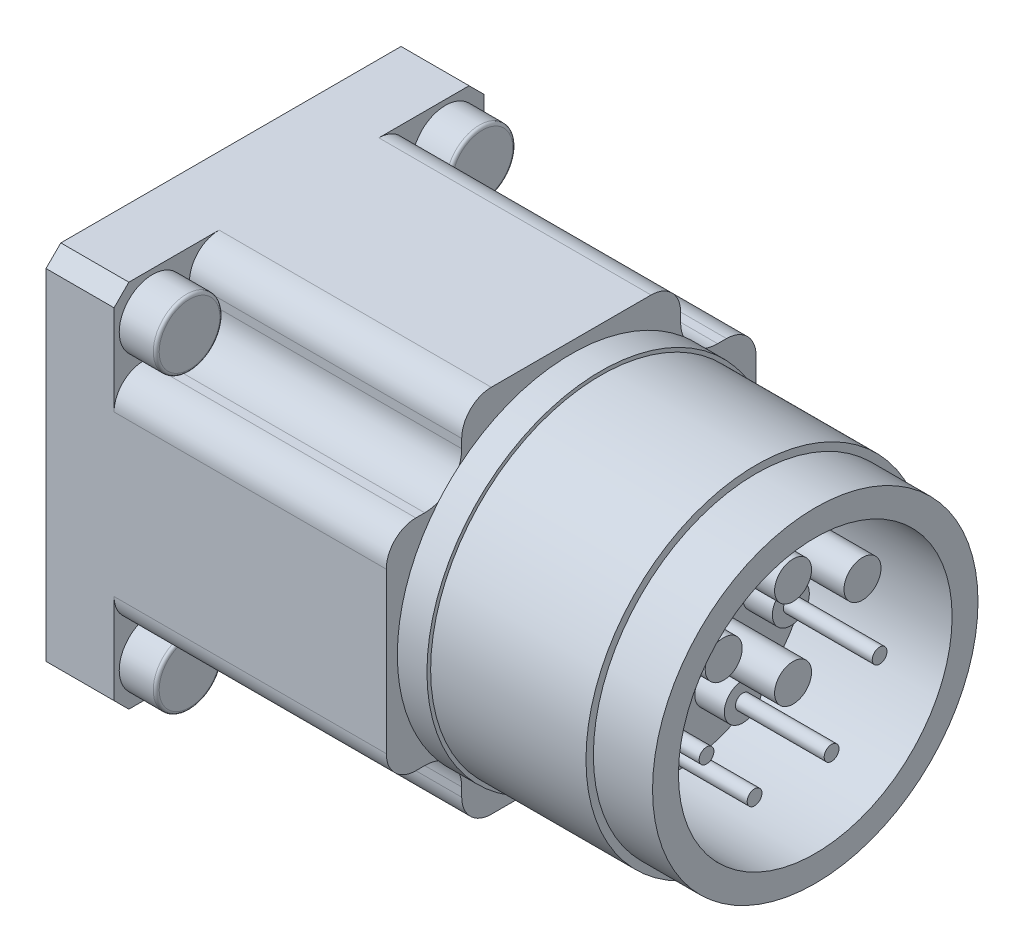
ISO-10303-21;
HEADER;
FILE_DESCRIPTION(('STEP AP214'),'2;1');
FILE_NAME('part.step','',(''),(''),'','','');
FILE_SCHEMA(('AUTOMOTIVE_DESIGN { 1 0 10303 214 1 1 1 1 }'));
ENDSEC;
DATA;
#1=APPLICATION_CONTEXT('core data for automotive mechanical design processes');
#2=APPLICATION_PROTOCOL_DEFINITION('international standard','automotive_design',2000,#1);
#3=PRODUCT_CONTEXT('',#1,'mechanical');
#4=PRODUCT('Part','Part','',(#3));
#5=PRODUCT_RELATED_PRODUCT_CATEGORY('part','',(#4));
#6=PRODUCT_DEFINITION_FORMATION('','',#4);
#7=PRODUCT_DEFINITION_CONTEXT('part definition',#1,'design');
#8=PRODUCT_DEFINITION('design','',#6,#7);
#9=PRODUCT_DEFINITION_SHAPE('','',#8);
#10=(LENGTH_UNIT() NAMED_UNIT(*) SI_UNIT(.MILLI.,.METRE.));
#11=(NAMED_UNIT(*) PLANE_ANGLE_UNIT() SI_UNIT($,.RADIAN.));
#12=(NAMED_UNIT(*) SI_UNIT($,.STERADIAN.) SOLID_ANGLE_UNIT());
#13=UNCERTAINTY_MEASURE_WITH_UNIT(LENGTH_MEASURE(1.E-05),#10,'distance_accuracy_value','');
#14=(GEOMETRIC_REPRESENTATION_CONTEXT(3) GLOBAL_UNCERTAINTY_ASSIGNED_CONTEXT((#13)) GLOBAL_UNIT_ASSIGNED_CONTEXT((#10,
#11,#12)) REPRESENTATION_CONTEXT('',''));
#15=CARTESIAN_POINT('',(0.,0.,0.));
#16=DIRECTION('',(0.,0.,1.));
#17=DIRECTION('',(1.,0.,0.));
#18=AXIS2_PLACEMENT_3D('',#15,#16,#17);
#19=CARTESIAN_POINT('',(4.6,0.,24.));
#20=DIRECTION('',(1.,0.,0.));
#21=DIRECTION('',(0.,0.,-1.));
#22=AXIS2_PLACEMENT_3D('',#19,#20,#21);
#23=PLANE('',#22);
#24=CARTESIAN_POINT('',(4.6,10.4999999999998,-5.39999999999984));
#25=DIRECTION('',(1.,0.,0.));
#26=DIRECTION('',(0.,0.,-1.));
#27=AXIS2_PLACEMENT_3D('',#24,#25,#26);
#28=CIRCLE('',#27,2.00000000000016);
#29=CARTESIAN_POINT('',(4.6,10.5,-7.4));
#30=VERTEX_POINT('',#29);
#31=CARTESIAN_POINT('',(4.6,12.5,-5.39999999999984));
#32=VERTEX_POINT('',#31);
#33=EDGE_CURVE('E367',#30,#32,#28,.T.);
#34=ORIENTED_EDGE('',*,*,#33,.F.);
#35=DIRECTION('',(0.,1.,0.));
#36=VECTOR('',#35,1.);
#37=CARTESIAN_POINT('',(4.6,9.9,-7.4));
#38=LINE('',#37,#36);
#39=CARTESIAN_POINT('',(4.6,9.9,-7.4));
#40=VERTEX_POINT('',#39);
#41=EDGE_CURVE('E380',#40,#30,#38,.T.);
#42=ORIENTED_EDGE('',*,*,#41,.F.);
#43=CARTESIAN_POINT('',(4.6,9.89999999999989,-9.89999999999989));
#44=DIRECTION('',(-1.,0.,0.));
#45=DIRECTION('',(0.,0.,1.));
#46=AXIS2_PLACEMENT_3D('',#43,#44,#45);
#47=CIRCLE('',#46,2.49999999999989);
#48=CARTESIAN_POINT('',(4.6,7.4,-9.9));
#49=VERTEX_POINT('',#48);
#50=EDGE_CURVE('E1551',#49,#40,#47,.T.);
#51=ORIENTED_EDGE('',*,*,#50,.F.);
#52=DIRECTION('',(0.,0.,1.));
#53=VECTOR('',#52,1.);
#54=CARTESIAN_POINT('',(4.6,7.4,-10.5));
#55=LINE('',#54,#53);
#56=CARTESIAN_POINT('',(4.6,7.4,-10.5));
#57=VERTEX_POINT('',#56);
#58=EDGE_CURVE('E671',#57,#49,#55,.T.);
#59=ORIENTED_EDGE('',*,*,#58,.F.);
#60=CARTESIAN_POINT('',(4.6,5.39999999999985,-10.4999999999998));
#61=DIRECTION('',(1.,0.,0.));
#62=DIRECTION('',(0.,0.,-1.));
#63=AXIS2_PLACEMENT_3D('',#60,#61,#62);
#64=CIRCLE('',#63,2.00000000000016);
#65=CARTESIAN_POINT('',(4.6,5.39999999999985,-12.5));
#66=VERTEX_POINT('',#65);
#67=EDGE_CURVE('E676',#66,#57,#64,.T.);
#68=ORIENTED_EDGE('',*,*,#67,.F.);
#69=DIRECTION('',(0.,1.,0.));
#70=VECTOR('',#69,1.);
#71=CARTESIAN_POINT('',(4.6,-11.5,-12.5));
#72=LINE('',#71,#70);
#73=CARTESIAN_POINT('',(4.6,11.5,-12.5));
#74=VERTEX_POINT('',#73);
#75=EDGE_CURVE('E515',#66,#74,#72,.T.);
#76=ORIENTED_EDGE('',*,*,#75,.T.);
#77=DIRECTION('',(0.,0.707106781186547,0.707106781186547));
#78=VECTOR('',#77,1.);
#79=CARTESIAN_POINT('',(4.6,11.5,-12.5));
#80=LINE('',#79,#78);
#81=CARTESIAN_POINT('',(4.6,12.5,-11.5));
#82=VERTEX_POINT('',#81);
#83=EDGE_CURVE('E507',#74,#82,#80,.T.);
#84=ORIENTED_EDGE('',*,*,#83,.T.);
#85=DIRECTION('',(0.,0.,1.));
#86=VECTOR('',#85,1.);
#87=CARTESIAN_POINT('',(4.6,12.5,-11.5));
#88=LINE('',#87,#86);
#89=EDGE_CURVE('E504',#82,#32,#88,.T.);
#90=ORIENTED_EDGE('',*,*,#89,.T.);
#91=EDGE_LOOP('',(#34,#42,#51,#59,#68,#76,#84,#90));
#92=FACE_BOUND('',#91,.T.);
#93=CARTESIAN_POINT('',(4.6,9.9,-9.9));
#94=DIRECTION('',(-1.,0.,0.));
#95=DIRECTION('',(0.,0.,1.));
#96=AXIS2_PLACEMENT_3D('',#93,#94,#95);
#97=CIRCLE('',#96,2.25);
#98=CARTESIAN_POINT('',(4.6,9.9,-7.65));
#99=VERTEX_POINT('',#98);
#100=EDGE_CURVE('E1202',#99,#99,#97,.T.);
#101=ORIENTED_EDGE('',*,*,#100,.T.);
#102=EDGE_LOOP('',(#101));
#103=FACE_BOUND('',#102,.T.);
#104=ADVANCED_FACE('F31',(#92,#103),#23,.T.);
#105=CARTESIAN_POINT('',(4.6,-5.39999999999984,-10.4999999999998));
#106=DIRECTION('',(1.,0.,0.));
#107=DIRECTION('',(0.,0.,-1.));
#108=AXIS2_PLACEMENT_3D('',#105,#106,#107);
#109=CIRCLE('',#108,2.00000000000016);
#110=CARTESIAN_POINT('',(4.6,-7.4,-10.5));
#111=VERTEX_POINT('',#110);
#112=CARTESIAN_POINT('',(4.6,-5.39999999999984,-12.5));
#113=VERTEX_POINT('',#112);
#114=EDGE_CURVE('E668',#111,#113,#109,.T.);
#115=ORIENTED_EDGE('',*,*,#114,.F.);
#116=DIRECTION('',(0.,0.,-1.));
#117=VECTOR('',#116,1.);
#118=CARTESIAN_POINT('',(4.6,-7.4,-9.9));
#119=LINE('',#118,#117);
#120=CARTESIAN_POINT('',(4.6,-7.4,-9.9));
#121=VERTEX_POINT('',#120);
#122=EDGE_CURVE('E665',#121,#111,#119,.T.);
#123=ORIENTED_EDGE('',*,*,#122,.F.);
#124=CARTESIAN_POINT('',(4.6,-9.89999999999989,-9.89999999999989));
#125=DIRECTION('',(-1.,0.,0.));
#126=DIRECTION('',(0.,0.,1.));
#127=AXIS2_PLACEMENT_3D('',#124,#125,#126);
#128=CIRCLE('',#127,2.49999999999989);
#129=CARTESIAN_POINT('',(4.6,-9.9,-7.4));
#130=VERTEX_POINT('',#129);
#131=EDGE_CURVE('E661',#130,#121,#128,.T.);
#132=ORIENTED_EDGE('',*,*,#131,.F.);
#133=DIRECTION('',(0.,1.,0.));
#134=VECTOR('',#133,1.);
#135=CARTESIAN_POINT('',(4.6,-10.5,-7.4));
#136=LINE('',#135,#134);
#137=CARTESIAN_POINT('',(4.6,-10.5,-7.4));
#138=VERTEX_POINT('',#137);
#139=EDGE_CURVE('E658',#138,#130,#136,.T.);
#140=ORIENTED_EDGE('',*,*,#139,.F.);
#141=CARTESIAN_POINT('',(4.6,-10.4999999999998,-5.39999999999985));
#142=DIRECTION('',(1.,0.,0.));
#143=DIRECTION('',(0.,0.,-1.));
#144=AXIS2_PLACEMENT_3D('',#141,#142,#143);
#145=CIRCLE('',#144,2.00000000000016);
#146=CARTESIAN_POINT('',(4.6,-12.5,-5.39999999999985));
#147=VERTEX_POINT('',#146);
#148=EDGE_CURVE('E662',#147,#138,#145,.T.);
#149=ORIENTED_EDGE('',*,*,#148,.F.);
#150=DIRECTION('',(0.,0.,-1.));
#151=VECTOR('',#150,1.);
#152=CARTESIAN_POINT('',(4.6,-12.5,11.5));
#153=LINE('',#152,#151);
#154=CARTESIAN_POINT('',(4.6,-12.5,-11.5));
#155=VERTEX_POINT('',#154);
#156=EDGE_CURVE('E526',#147,#155,#153,.T.);
#157=ORIENTED_EDGE('',*,*,#156,.T.);
#158=DIRECTION('',(0.,0.707106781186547,-0.707106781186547));
#159=VECTOR('',#158,1.);
#160=CARTESIAN_POINT('',(4.6,-12.5,-11.5));
#161=LINE('',#160,#159);
#162=CARTESIAN_POINT('',(4.6,-11.5,-12.5));
#163=VERTEX_POINT('',#162);
#164=EDGE_CURVE('E518',#155,#163,#161,.T.);
#165=ORIENTED_EDGE('',*,*,#164,.T.);
#166=EDGE_CURVE('E517',#163,#113,#72,.T.);
#167=ORIENTED_EDGE('',*,*,#166,.T.);
#168=EDGE_LOOP('',(#115,#123,#132,#140,#149,#157,#165,#167));
#169=FACE_BOUND('',#168,.T.);
#170=CARTESIAN_POINT('',(4.6,-9.9,-9.9));
#171=DIRECTION('',(-1.,0.,0.));
#172=DIRECTION('',(0.,0.,1.));
#173=AXIS2_PLACEMENT_3D('',#170,#171,#172);
#174=CIRCLE('',#173,2.25);
#175=CARTESIAN_POINT('',(4.6,-9.9,-7.65));
#176=VERTEX_POINT('',#175);
#177=EDGE_CURVE('E1213',#176,#176,#174,.T.);
#178=ORIENTED_EDGE('',*,*,#177,.T.);
#179=EDGE_LOOP('',(#178));
#180=FACE_BOUND('',#179,.T.);
#181=ADVANCED_FACE('F752',(#169,#180),#23,.T.);
#182=CARTESIAN_POINT('',(4.6,-5.39999999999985,10.4999999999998));
#183=DIRECTION('',(1.,0.,0.));
#184=DIRECTION('',(0.,0.,-1.));
#185=AXIS2_PLACEMENT_3D('',#182,#183,#184);
#186=CIRCLE('',#185,2.00000000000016);
#187=CARTESIAN_POINT('',(4.6,-5.39999999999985,12.5));
#188=VERTEX_POINT('',#187);
#189=CARTESIAN_POINT('',(4.6,-7.4,10.5));
#190=VERTEX_POINT('',#189);
#191=EDGE_CURVE('E276',#188,#190,#186,.T.);
#192=ORIENTED_EDGE('',*,*,#191,.F.);
#193=DIRECTION('',(0.,-1.,0.));
#194=VECTOR('',#193,1.);
#195=CARTESIAN_POINT('',(4.6,11.5,12.5));
#196=LINE('',#195,#194);
#197=CARTESIAN_POINT('',(4.6,-11.5,12.5));
#198=VERTEX_POINT('',#197);
#199=EDGE_CURVE('E469',#188,#198,#196,.T.);
#200=ORIENTED_EDGE('',*,*,#199,.T.);
#201=DIRECTION('',(0.,-0.707106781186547,-0.707106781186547));
#202=VECTOR('',#201,1.);
#203=CARTESIAN_POINT('',(4.6,-11.5,12.5));
#204=LINE('',#203,#202);
#205=CARTESIAN_POINT('',(4.6,-12.5,11.5));
#206=VERTEX_POINT('',#205);
#207=EDGE_CURVE('E472',#198,#206,#204,.T.);
#208=ORIENTED_EDGE('',*,*,#207,.T.);
#209=CARTESIAN_POINT('',(4.6,-12.5,5.39999999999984));
#210=VERTEX_POINT('',#209);
#211=EDGE_CURVE('E523',#206,#210,#153,.T.);
#212=ORIENTED_EDGE('',*,*,#211,.T.);
#213=CARTESIAN_POINT('',(4.6,-10.4999999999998,5.39999999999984));
#214=DIRECTION('',(1.,0.,0.));
#215=DIRECTION('',(0.,0.,-1.));
#216=AXIS2_PLACEMENT_3D('',#213,#214,#215);
#217=CIRCLE('',#216,2.00000000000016);
#218=CARTESIAN_POINT('',(4.6,-10.5,7.4));
#219=VERTEX_POINT('',#218);
#220=EDGE_CURVE('E556',#219,#210,#217,.T.);
#221=ORIENTED_EDGE('',*,*,#220,.F.);
#222=DIRECTION('',(0.,-1.,0.));
#223=VECTOR('',#222,1.);
#224=CARTESIAN_POINT('',(4.6,-9.9,7.4));
#225=LINE('',#224,#223);
#226=CARTESIAN_POINT('',(4.6,-9.9,7.4));
#227=VERTEX_POINT('',#226);
#228=EDGE_CURVE('E654',#227,#219,#225,.T.);
#229=ORIENTED_EDGE('',*,*,#228,.F.);
#230=CARTESIAN_POINT('',(4.6,-9.89999999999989,9.89999999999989));
#231=DIRECTION('',(-1.,0.,0.));
#232=DIRECTION('',(0.,0.,1.));
#233=AXIS2_PLACEMENT_3D('',#230,#231,#232);
#234=CIRCLE('',#233,2.49999999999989);
#235=CARTESIAN_POINT('',(4.6,-7.4,9.9));
#236=VERTEX_POINT('',#235);
#237=EDGE_CURVE('E651',#236,#227,#234,.T.);
#238=ORIENTED_EDGE('',*,*,#237,.F.);
#239=DIRECTION('',(0.,0.,-1.));
#240=VECTOR('',#239,1.);
#241=CARTESIAN_POINT('',(4.6,-7.4,10.5));
#242=LINE('',#241,#240);
#243=EDGE_CURVE('E648',#190,#236,#242,.T.);
#244=ORIENTED_EDGE('',*,*,#243,.F.);
#245=EDGE_LOOP('',(#192,#200,#208,#212,#221,#229,#238,#244));
#246=FACE_BOUND('',#245,.T.);
#247=CARTESIAN_POINT('',(4.6,-9.9,9.9));
#248=DIRECTION('',(-1.,0.,0.));
#249=DIRECTION('',(0.,0.,1.));
#250=AXIS2_PLACEMENT_3D('',#247,#248,#249);
#251=CIRCLE('',#250,2.25);
#252=CARTESIAN_POINT('',(4.6,-9.9,12.15));
#253=VERTEX_POINT('',#252);
#254=EDGE_CURVE('E1222',#253,#253,#251,.T.);
#255=ORIENTED_EDGE('',*,*,#254,.T.);
#256=EDGE_LOOP('',(#255));
#257=FACE_BOUND('',#256,.T.);
#258=ADVANCED_FACE('F535',(#246,#257),#23,.T.);
#259=CARTESIAN_POINT('',(4.6,5.39999999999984,10.4999999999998));
#260=DIRECTION('',(1.,0.,0.));
#261=DIRECTION('',(0.,0.,-1.));
#262=AXIS2_PLACEMENT_3D('',#259,#260,#261);
#263=CIRCLE('',#262,2.00000000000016);
#264=CARTESIAN_POINT('',(4.6,7.4,10.5));
#265=VERTEX_POINT('',#264);
#266=CARTESIAN_POINT('',(4.6,5.39999999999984,12.5));
#267=VERTEX_POINT('',#266);
#268=EDGE_CURVE('E57',#265,#267,#263,.T.);
#269=ORIENTED_EDGE('',*,*,#268,.F.);
#270=DIRECTION('',(0.,0.,1.));
#271=VECTOR('',#270,1.);
#272=CARTESIAN_POINT('',(4.6,7.4,9.9));
#273=LINE('',#272,#271);
#274=CARTESIAN_POINT('',(4.6,7.4,9.9));
#275=VERTEX_POINT('',#274);
#276=EDGE_CURVE('E349',#275,#265,#273,.T.);
#277=ORIENTED_EDGE('',*,*,#276,.F.);
#278=CARTESIAN_POINT('',(4.6,9.89999999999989,9.89999999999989));
#279=DIRECTION('',(-1.,0.,0.));
#280=DIRECTION('',(0.,0.,1.));
#281=AXIS2_PLACEMENT_3D('',#278,#279,#280);
#282=CIRCLE('',#281,2.49999999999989);
#283=CARTESIAN_POINT('',(4.6,9.9,7.4));
#284=VERTEX_POINT('',#283);
#285=EDGE_CURVE('E387',#284,#275,#282,.T.);
#286=ORIENTED_EDGE('',*,*,#285,.F.);
#287=DIRECTION('',(0.,-1.,0.));
#288=VECTOR('',#287,1.);
#289=CARTESIAN_POINT('',(4.6,10.5,7.4));
#290=LINE('',#289,#288);
#291=CARTESIAN_POINT('',(4.6,10.5,7.4));
#292=VERTEX_POINT('',#291);
#293=EDGE_CURVE('E366',#292,#284,#290,.T.);
#294=ORIENTED_EDGE('',*,*,#293,.F.);
#295=CARTESIAN_POINT('',(4.6,10.4999999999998,5.39999999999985));
#296=DIRECTION('',(1.,0.,0.));
#297=DIRECTION('',(0.,0.,-1.));
#298=AXIS2_PLACEMENT_3D('',#295,#296,#297);
#299=CIRCLE('',#298,2.00000000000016);
#300=CARTESIAN_POINT('',(4.6,12.5,5.39999999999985));
#301=VERTEX_POINT('',#300);
#302=EDGE_CURVE('E363',#301,#292,#299,.T.);
#303=ORIENTED_EDGE('',*,*,#302,.F.);
#304=CARTESIAN_POINT('',(4.6,12.5,11.5));
#305=VERTEX_POINT('',#304);
#306=EDGE_CURVE('E511',#301,#305,#88,.T.);
#307=ORIENTED_EDGE('',*,*,#306,.T.);
#308=DIRECTION('',(0.,-0.707106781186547,0.707106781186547));
#309=VECTOR('',#308,1.);
#310=CARTESIAN_POINT('',(4.6,12.5,11.5));
#311=LINE('',#310,#309);
#312=CARTESIAN_POINT('',(4.6,11.5,12.5));
#313=VERTEX_POINT('',#312);
#314=EDGE_CURVE('E466',#305,#313,#311,.T.);
#315=ORIENTED_EDGE('',*,*,#314,.T.);
#316=EDGE_CURVE('E478',#313,#267,#196,.T.);
#317=ORIENTED_EDGE('',*,*,#316,.T.);
#318=EDGE_LOOP('',(#269,#277,#286,#294,#303,#307,#315,#317));
#319=FACE_BOUND('',#318,.T.);
#320=CARTESIAN_POINT('',(4.6,9.9,9.9));
#321=DIRECTION('',(-1.,0.,0.));
#322=DIRECTION('',(0.,0.,1.));
#323=AXIS2_PLACEMENT_3D('',#320,#321,#322);
#324=CIRCLE('',#323,2.25);
#325=CARTESIAN_POINT('',(4.6,9.9,12.15));
#326=VERTEX_POINT('',#325);
#327=EDGE_CURVE('E776',#326,#326,#324,.T.);
#328=ORIENTED_EDGE('',*,*,#327,.T.);
#329=EDGE_LOOP('',(#328));
#330=FACE_BOUND('',#329,.T.);
#331=ADVANCED_FACE('F758',(#319,#330),#23,.T.);
#332=CARTESIAN_POINT('',(30.,-1.3351256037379,-5.8495674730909));
#333=DIRECTION('',(1.,0.,0.));
#334=DIRECTION('',(0.,0.,-1.));
#335=AXIS2_PLACEMENT_3D('',#332,#333,#334);
#336=CYLINDRICAL_SURFACE('',#335,1.25);
#337=CARTESIAN_POINT('',(30.,-1.3351256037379,-5.8495674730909));
#338=DIRECTION('',(1.,0.,0.));
#339=DIRECTION('',(0.,0.,-1.));
#340=AXIS2_PLACEMENT_3D('',#337,#338,#339);
#341=CIRCLE('',#340,1.25);
#342=CARTESIAN_POINT('',(30.,-1.3351256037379,-7.0995674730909));
#343=VERTEX_POINT('',#342);
#344=EDGE_CURVE('E626',#343,#343,#341,.T.);
#345=ORIENTED_EDGE('',*,*,#344,.T.);
#346=EDGE_LOOP('',(#345));
#347=FACE_BOUND('',#346,.T.);
#348=CARTESIAN_POINT('',(32.,-1.3351256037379,-5.8495674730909));
#349=DIRECTION('',(1.,0.,0.));
#350=DIRECTION('',(0.,0.,-1.));
#351=AXIS2_PLACEMENT_3D('',#348,#349,#350);
#352=CIRCLE('',#351,1.25);
#353=CARTESIAN_POINT('',(32.,-1.3351256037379,-7.0995674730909));
#354=VERTEX_POINT('',#353);
#355=EDGE_CURVE('E602',#354,#354,#352,.F.);
#356=ORIENTED_EDGE('',*,*,#355,.T.);
#357=EDGE_LOOP('',(#356));
#358=FACE_BOUND('',#357,.T.);
#359=ADVANCED_FACE('F766',(#347,#358),#336,.T.);
#360=CARTESIAN_POINT('',(30.,-5.4058132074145,-2.6033024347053));
#361=DIRECTION('',(1.,0.,0.));
#362=DIRECTION('',(0.,0.,-1.));
#363=AXIS2_PLACEMENT_3D('',#360,#361,#362);
#364=CYLINDRICAL_SURFACE('',#363,1.25);
#365=CARTESIAN_POINT('',(30.,-5.4058132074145,-2.6033024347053));
#366=DIRECTION('',(1.,0.,0.));
#367=DIRECTION('',(0.,0.,-1.));
#368=AXIS2_PLACEMENT_3D('',#365,#366,#367);
#369=CIRCLE('',#368,1.25);
#370=CARTESIAN_POINT('',(30.,-5.4058132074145,-3.8533024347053));
#371=VERTEX_POINT('',#370);
#372=EDGE_CURVE('E620',#371,#371,#369,.T.);
#373=ORIENTED_EDGE('',*,*,#372,.T.);
#374=EDGE_LOOP('',(#373));
#375=FACE_BOUND('',#374,.T.);
#376=CARTESIAN_POINT('',(32.,-5.4058132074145,-2.6033024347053));
#377=DIRECTION('',(1.,0.,0.));
#378=DIRECTION('',(0.,0.,-1.));
#379=AXIS2_PLACEMENT_3D('',#376,#377,#378);
#380=CIRCLE('',#379,1.25);
#381=CARTESIAN_POINT('',(32.,-5.4058132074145,-3.8533024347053));
#382=VERTEX_POINT('',#381);
#383=EDGE_CURVE('E595',#382,#382,#380,.F.);
#384=ORIENTED_EDGE('',*,*,#383,.T.);
#385=EDGE_LOOP('',(#384));
#386=FACE_BOUND('',#385,.T.);
#387=ADVANCED_FACE('F770',(#375,#386),#364,.T.);
#388=CARTESIAN_POINT('',(30.,-5.4058132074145,2.6033024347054));
#389=DIRECTION('',(1.,0.,0.));
#390=DIRECTION('',(0.,0.,-1.));
#391=AXIS2_PLACEMENT_3D('',#388,#389,#390);
#392=CYLINDRICAL_SURFACE('',#391,1.25);
#393=CARTESIAN_POINT('',(30.,-5.4058132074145,2.6033024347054));
#394=DIRECTION('',(1.,0.,0.));
#395=DIRECTION('',(0.,0.,-1.));
#396=AXIS2_PLACEMENT_3D('',#393,#394,#395);
#397=CIRCLE('',#396,1.25);
#398=CARTESIAN_POINT('',(30.,-5.4058132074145,1.3533024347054));
#399=VERTEX_POINT('',#398);
#400=EDGE_CURVE('E611',#399,#399,#397,.T.);
#401=ORIENTED_EDGE('',*,*,#400,.T.);
#402=EDGE_LOOP('',(#401));
#403=FACE_BOUND('',#402,.T.);
#404=CARTESIAN_POINT('',(32.,-5.4058132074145,2.6033024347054));
#405=DIRECTION('',(1.,0.,0.));
#406=DIRECTION('',(0.,0.,-1.));
#407=AXIS2_PLACEMENT_3D('',#404,#405,#406);
#408=CIRCLE('',#407,1.25);
#409=CARTESIAN_POINT('',(32.,-5.4058132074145,1.3533024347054));
#410=VERTEX_POINT('',#409);
#411=EDGE_CURVE('E590',#410,#410,#408,.F.);
#412=ORIENTED_EDGE('',*,*,#411,.T.);
#413=EDGE_LOOP('',(#412));
#414=FACE_BOUND('',#413,.T.);
#415=ADVANCED_FACE('F841',(#403,#414),#392,.T.);
#416=CARTESIAN_POINT('',(30.,-1.3351256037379,5.8495674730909));
#417=DIRECTION('',(1.,0.,0.));
#418=DIRECTION('',(0.,0.,-1.));
#419=AXIS2_PLACEMENT_3D('',#416,#417,#418);
#420=CYLINDRICAL_SURFACE('',#419,1.25);
#421=CARTESIAN_POINT('',(30.,-1.3351256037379,5.8495674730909));
#422=DIRECTION('',(1.,0.,0.));
#423=DIRECTION('',(0.,0.,-1.));
#424=AXIS2_PLACEMENT_3D('',#421,#422,#423);
#425=CIRCLE('',#424,1.25);
#426=CARTESIAN_POINT('',(30.,-1.3351256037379,4.5995674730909));
#427=VERTEX_POINT('',#426);
#428=EDGE_CURVE('E605',#427,#427,#425,.T.);
#429=ORIENTED_EDGE('',*,*,#428,.T.);
#430=EDGE_LOOP('',(#429));
#431=FACE_BOUND('',#430,.T.);
#432=CARTESIAN_POINT('',(32.,-1.3351256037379,5.8495674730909));
#433=DIRECTION('',(1.,0.,0.));
#434=DIRECTION('',(0.,0.,-1.));
#435=AXIS2_PLACEMENT_3D('',#432,#433,#434);
#436=CIRCLE('',#435,1.25);
#437=CARTESIAN_POINT('',(32.,-1.3351256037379,4.5995674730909));
#438=VERTEX_POINT('',#437);
#439=EDGE_CURVE('E586',#438,#438,#436,.F.);
#440=ORIENTED_EDGE('',*,*,#439,.T.);
#441=EDGE_LOOP('',(#440));
#442=FACE_BOUND('',#441,.T.);
#443=ADVANCED_FACE('F843',(#431,#442),#420,.T.);
#444=CARTESIAN_POINT('',(23.,-5.39999999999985,10.4999999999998));
#445=DIRECTION('',(1.,0.,0.));
#446=DIRECTION('',(0.,0.,-1.));
#447=AXIS2_PLACEMENT_3D('',#444,#445,#446);
#448=PLANE('',#447);
#449=CARTESIAN_POINT('',(23.,9.89999999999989,9.89999999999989));
#450=DIRECTION('',(-1.,0.,0.));
#451=DIRECTION('',(0.,0.,1.));
#452=AXIS2_PLACEMENT_3D('',#449,#450,#451);
#453=CIRCLE('',#452,2.49999999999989);
#454=CARTESIAN_POINT('',(23.,9.9,7.4));
#455=VERTEX_POINT('',#454);
#456=CARTESIAN_POINT('',(23.,8.98291171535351,7.57428525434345));
#457=VERTEX_POINT('',#456);
#458=EDGE_CURVE('E285',#455,#457,#453,.T.);
#459=ORIENTED_EDGE('',*,*,#458,.T.);
#460=CARTESIAN_POINT('',(23.,0.,0.));
#461=DIRECTION('',(-1.,0.,0.));
#462=DIRECTION('',(0.,0.,1.));
#463=AXIS2_PLACEMENT_3D('',#460,#461,#462);
#464=CIRCLE('',#463,11.75);
#465=CARTESIAN_POINT('',(23.,8.98291171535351,-7.57428525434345));
#466=VERTEX_POINT('',#465);
#467=EDGE_CURVE('E11',#457,#466,#464,.T.);
#468=ORIENTED_EDGE('',*,*,#467,.T.);
#469=CARTESIAN_POINT('',(23.,9.89999999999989,-9.89999999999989));
#470=DIRECTION('',(-1.,0.,0.));
#471=DIRECTION('',(0.,0.,1.));
#472=AXIS2_PLACEMENT_3D('',#469,#470,#471);
#473=CIRCLE('',#472,2.49999999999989);
#474=CARTESIAN_POINT('',(23.,9.9,-7.4));
#475=VERTEX_POINT('',#474);
#476=EDGE_CURVE('E311',#466,#475,#473,.T.);
#477=ORIENTED_EDGE('',*,*,#476,.T.);
#478=DIRECTION('',(0.,1.,0.));
#479=VECTOR('',#478,1.);
#480=CARTESIAN_POINT('',(23.,9.9,-7.4));
#481=LINE('',#480,#479);
#482=CARTESIAN_POINT('',(23.,10.5,-7.4));
#483=VERTEX_POINT('',#482);
#484=EDGE_CURVE('E305',#475,#483,#481,.T.);
#485=ORIENTED_EDGE('',*,*,#484,.T.);
#486=CARTESIAN_POINT('',(23.,10.4999999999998,-5.39999999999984));
#487=DIRECTION('',(1.,0.,0.));
#488=DIRECTION('',(0.,0.,-1.));
#489=AXIS2_PLACEMENT_3D('',#486,#487,#488);
#490=CIRCLE('',#489,2.00000000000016);
#491=CARTESIAN_POINT('',(23.,12.5,-5.4));
#492=VERTEX_POINT('',#491);
#493=EDGE_CURVE('E303',#483,#492,#490,.T.);
#494=ORIENTED_EDGE('',*,*,#493,.T.);
#495=DIRECTION('',(0.,0.,1.));
#496=VECTOR('',#495,1.);
#497=CARTESIAN_POINT('',(23.,12.5,-5.4));
#498=LINE('',#497,#496);
#499=CARTESIAN_POINT('',(23.,12.5,5.4));
#500=VERTEX_POINT('',#499);
#501=EDGE_CURVE('E299',#492,#500,#498,.T.);
#502=ORIENTED_EDGE('',*,*,#501,.T.);
#503=CARTESIAN_POINT('',(23.,10.4999999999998,5.39999999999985));
#504=DIRECTION('',(1.,0.,0.));
#505=DIRECTION('',(0.,0.,-1.));
#506=AXIS2_PLACEMENT_3D('',#503,#504,#505);
#507=CIRCLE('',#506,2.00000000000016);
#508=CARTESIAN_POINT('',(23.,10.5,7.4));
#509=VERTEX_POINT('',#508);
#510=EDGE_CURVE('E298',#500,#509,#507,.T.);
#511=ORIENTED_EDGE('',*,*,#510,.T.);
#512=DIRECTION('',(0.,-1.,0.));
#513=VECTOR('',#512,1.);
#514=CARTESIAN_POINT('',(23.,10.5,7.4));
#515=LINE('',#514,#513);
#516=EDGE_CURVE('E291',#509,#455,#515,.T.);
#517=ORIENTED_EDGE('',*,*,#516,.T.);
#518=EDGE_LOOP('',(#459,#468,#477,#485,#494,#502,#511,#517));
#519=FACE_BOUND('',#518,.T.);
#520=ADVANCED_FACE('F289',(#519),#448,.T.);
#521=CARTESIAN_POINT('',(23.,7.4,-9.9));
#522=VERTEX_POINT('',#521);
#523=CARTESIAN_POINT('',(23.,7.57428525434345,-8.98291171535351));
#524=VERTEX_POINT('',#523);
#525=EDGE_CURVE('E307',#522,#524,#473,.T.);
#526=ORIENTED_EDGE('',*,*,#525,.T.);
#527=CARTESIAN_POINT('',(23.,-7.57428525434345,-8.98291171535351));
#528=VERTEX_POINT('',#527);
#529=EDGE_CURVE('E40',#524,#528,#464,.T.);
#530=ORIENTED_EDGE('',*,*,#529,.T.);
#531=CARTESIAN_POINT('',(23.,-9.89999999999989,-9.89999999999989));
#532=DIRECTION('',(-1.,0.,0.));
#533=DIRECTION('',(0.,0.,1.));
#534=AXIS2_PLACEMENT_3D('',#531,#532,#533);
#535=CIRCLE('',#534,2.49999999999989);
#536=CARTESIAN_POINT('',(23.,-7.4,-9.9));
#537=VERTEX_POINT('',#536);
#538=EDGE_CURVE('E326',#528,#537,#535,.T.);
#539=ORIENTED_EDGE('',*,*,#538,.T.);
#540=DIRECTION('',(0.,0.,-1.));
#541=VECTOR('',#540,1.);
#542=CARTESIAN_POINT('',(23.,-7.4,-9.9));
#543=LINE('',#542,#541);
#544=CARTESIAN_POINT('',(23.,-7.4,-10.5));
#545=VERTEX_POINT('',#544);
#546=EDGE_CURVE('E320',#537,#545,#543,.T.);
#547=ORIENTED_EDGE('',*,*,#546,.T.);
#548=CARTESIAN_POINT('',(23.,-5.39999999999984,-10.4999999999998));
#549=DIRECTION('',(1.,0.,0.));
#550=DIRECTION('',(0.,0.,-1.));
#551=AXIS2_PLACEMENT_3D('',#548,#549,#550);
#552=CIRCLE('',#551,2.00000000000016);
#553=CARTESIAN_POINT('',(23.,-5.4,-12.5));
#554=VERTEX_POINT('',#553);
#555=EDGE_CURVE('E318',#545,#554,#552,.T.);
#556=ORIENTED_EDGE('',*,*,#555,.T.);
#557=DIRECTION('',(0.,1.,0.));
#558=VECTOR('',#557,1.);
#559=CARTESIAN_POINT('',(23.,-5.4,-12.5));
#560=LINE('',#559,#558);
#561=CARTESIAN_POINT('',(23.,5.4,-12.5));
#562=VERTEX_POINT('',#561);
#563=EDGE_CURVE('E316',#554,#562,#560,.T.);
#564=ORIENTED_EDGE('',*,*,#563,.T.);
#565=CARTESIAN_POINT('',(23.,5.39999999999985,-10.4999999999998));
#566=DIRECTION('',(1.,0.,0.));
#567=DIRECTION('',(0.,0.,-1.));
#568=AXIS2_PLACEMENT_3D('',#565,#566,#567);
#569=CIRCLE('',#568,2.00000000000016);
#570=CARTESIAN_POINT('',(23.,7.4,-10.5));
#571=VERTEX_POINT('',#570);
#572=EDGE_CURVE('E314',#562,#571,#569,.T.);
#573=ORIENTED_EDGE('',*,*,#572,.T.);
#574=DIRECTION('',(0.,0.,1.));
#575=VECTOR('',#574,1.);
#576=CARTESIAN_POINT('',(23.,7.4,-10.5));
#577=LINE('',#576,#575);
#578=EDGE_CURVE('E312',#571,#522,#577,.T.);
#579=ORIENTED_EDGE('',*,*,#578,.T.);
#580=EDGE_LOOP('',(#526,#530,#539,#547,#556,#564,#573,#579));
#581=FACE_BOUND('',#580,.T.);
#582=ADVANCED_FACE('F729',(#581),#448,.T.);
#583=CARTESIAN_POINT('',(23.,-9.9,-7.4));
#584=VERTEX_POINT('',#583);
#585=CARTESIAN_POINT('',(23.,-8.98291171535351,-7.57428525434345));
#586=VERTEX_POINT('',#585);
#587=EDGE_CURVE('E322',#584,#586,#535,.T.);
#588=ORIENTED_EDGE('',*,*,#587,.T.);
#589=CARTESIAN_POINT('',(23.,-8.98291171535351,7.57428525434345));
#590=VERTEX_POINT('',#589);
#591=EDGE_CURVE('E722',#586,#590,#464,.T.);
#592=ORIENTED_EDGE('',*,*,#591,.T.);
#593=CARTESIAN_POINT('',(23.,-9.89999999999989,9.89999999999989));
#594=DIRECTION('',(-1.,0.,0.));
#595=DIRECTION('',(0.,0.,1.));
#596=AXIS2_PLACEMENT_3D('',#593,#594,#595);
#597=CIRCLE('',#596,2.49999999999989);
#598=CARTESIAN_POINT('',(23.,-9.9,7.4));
#599=VERTEX_POINT('',#598);
#600=EDGE_CURVE('E341',#590,#599,#597,.T.);
#601=ORIENTED_EDGE('',*,*,#600,.T.);
#602=DIRECTION('',(0.,-1.,0.));
#603=VECTOR('',#602,1.);
#604=CARTESIAN_POINT('',(23.,-9.9,7.4));
#605=LINE('',#604,#603);
#606=CARTESIAN_POINT('',(23.,-10.5,7.4));
#607=VERTEX_POINT('',#606);
#608=EDGE_CURVE('E335',#599,#607,#605,.T.);
#609=ORIENTED_EDGE('',*,*,#608,.T.);
#610=CARTESIAN_POINT('',(23.,-10.4999999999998,5.39999999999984));
#611=DIRECTION('',(1.,0.,0.));
#612=DIRECTION('',(0.,0.,-1.));
#613=AXIS2_PLACEMENT_3D('',#610,#611,#612);
#614=CIRCLE('',#613,2.00000000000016);
#615=CARTESIAN_POINT('',(23.,-12.5,5.4));
#616=VERTEX_POINT('',#615);
#617=EDGE_CURVE('E333',#607,#616,#614,.T.);
#618=ORIENTED_EDGE('',*,*,#617,.T.);
#619=DIRECTION('',(0.,0.,-1.));
#620=VECTOR('',#619,1.);
#621=CARTESIAN_POINT('',(23.,-12.5,5.4));
#622=LINE('',#621,#620);
#623=CARTESIAN_POINT('',(23.,-12.5,-5.4));
#624=VERTEX_POINT('',#623);
#625=EDGE_CURVE('E331',#616,#624,#622,.T.);
#626=ORIENTED_EDGE('',*,*,#625,.T.);
#627=CARTESIAN_POINT('',(23.,-10.4999999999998,-5.39999999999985));
#628=DIRECTION('',(1.,0.,0.));
#629=DIRECTION('',(0.,0.,-1.));
#630=AXIS2_PLACEMENT_3D('',#627,#628,#629);
#631=CIRCLE('',#630,2.00000000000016);
#632=CARTESIAN_POINT('',(23.,-10.5,-7.4));
#633=VERTEX_POINT('',#632);
#634=EDGE_CURVE('E329',#624,#633,#631,.T.);
#635=ORIENTED_EDGE('',*,*,#634,.T.);
#636=DIRECTION('',(0.,1.,0.));
#637=VECTOR('',#636,1.);
#638=CARTESIAN_POINT('',(23.,-10.5,-7.4));
#639=LINE('',#638,#637);
#640=EDGE_CURVE('E327',#633,#584,#639,.T.);
#641=ORIENTED_EDGE('',*,*,#640,.T.);
#642=EDGE_LOOP('',(#588,#592,#601,#609,#618,#626,#635,#641));
#643=FACE_BOUND('',#642,.T.);
#644=ADVANCED_FACE('F721',(#643),#448,.T.);
#645=CARTESIAN_POINT('',(23.,-7.4,9.9));
#646=VERTEX_POINT('',#645);
#647=CARTESIAN_POINT('',(23.,-7.57428525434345,8.98291171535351));
#648=VERTEX_POINT('',#647);
#649=EDGE_CURVE('E337',#646,#648,#597,.T.);
#650=ORIENTED_EDGE('',*,*,#649,.T.);
#651=CARTESIAN_POINT('',(23.,7.57428525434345,8.98291171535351));
#652=VERTEX_POINT('',#651);
#653=EDGE_CURVE('E278',#648,#652,#464,.T.);
#654=ORIENTED_EDGE('',*,*,#653,.T.);
#655=CARTESIAN_POINT('',(23.,7.4,9.9));
#656=VERTEX_POINT('',#655);
#657=EDGE_CURVE('E287',#652,#656,#453,.T.);
#658=ORIENTED_EDGE('',*,*,#657,.T.);
#659=DIRECTION('',(0.,0.,1.));
#660=VECTOR('',#659,1.);
#661=CARTESIAN_POINT('',(23.,7.4,9.9));
#662=LINE('',#661,#660);
#663=CARTESIAN_POINT('',(23.,7.4,10.5));
#664=VERTEX_POINT('',#663);
#665=EDGE_CURVE('E293',#656,#664,#662,.T.);
#666=ORIENTED_EDGE('',*,*,#665,.T.);
#667=CARTESIAN_POINT('',(23.,5.39999999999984,10.4999999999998));
#668=DIRECTION('',(1.,0.,0.));
#669=DIRECTION('',(0.,0.,-1.));
#670=AXIS2_PLACEMENT_3D('',#667,#668,#669);
#671=CIRCLE('',#670,2.00000000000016);
#672=CARTESIAN_POINT('',(23.,5.4,12.5));
#673=VERTEX_POINT('',#672);
#674=EDGE_CURVE('E294',#664,#673,#671,.T.);
#675=ORIENTED_EDGE('',*,*,#674,.T.);
#676=DIRECTION('',(0.,-1.,0.));
#677=VECTOR('',#676,1.);
#678=CARTESIAN_POINT('',(23.,5.4,12.5));
#679=LINE('',#678,#677);
#680=CARTESIAN_POINT('',(23.,-5.4,12.5));
#681=VERTEX_POINT('',#680);
#682=EDGE_CURVE('E403',#673,#681,#679,.T.);
#683=ORIENTED_EDGE('',*,*,#682,.T.);
#684=CARTESIAN_POINT('',(23.,-5.39999999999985,10.4999999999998));
#685=DIRECTION('',(1.,0.,0.));
#686=DIRECTION('',(0.,0.,-1.));
#687=AXIS2_PLACEMENT_3D('',#684,#685,#686);
#688=CIRCLE('',#687,2.00000000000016);
#689=CARTESIAN_POINT('',(23.,-7.4,10.5));
#690=VERTEX_POINT('',#689);
#691=EDGE_CURVE('E344',#681,#690,#688,.T.);
#692=ORIENTED_EDGE('',*,*,#691,.T.);
#693=DIRECTION('',(0.,0.,-1.));
#694=VECTOR('',#693,1.);
#695=CARTESIAN_POINT('',(23.,-7.4,10.5));
#696=LINE('',#695,#694);
#697=EDGE_CURVE('E342',#690,#646,#696,.T.);
#698=ORIENTED_EDGE('',*,*,#697,.T.);
#699=EDGE_LOOP('',(#650,#654,#658,#666,#675,#683,#692,#698));
#700=FACE_BOUND('',#699,.T.);
#701=ADVANCED_FACE('F713',(#700),#448,.T.);
#702=CARTESIAN_POINT('',(4.6,12.5,11.5));
#703=DIRECTION('',(0.,-0.707106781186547,-0.707106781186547));
#704=DIRECTION('',(0.,0.707106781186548,-0.707106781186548));
#705=AXIS2_PLACEMENT_3D('',#702,#703,#704);
#706=PLANE('',#705);
#707=DIRECTION('',(0.,-0.707106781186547,0.707106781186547));
#708=VECTOR('',#707,1.);
#709=CARTESIAN_POINT('',(0.,12.5,11.5));
#710=LINE('',#709,#708);
#711=CARTESIAN_POINT('',(0.,12.5,11.5));
#712=VERTEX_POINT('',#711);
#713=CARTESIAN_POINT('',(0.,11.5,12.5));
#714=VERTEX_POINT('',#713);
#715=EDGE_CURVE('E449',#712,#714,#710,.T.);
#716=ORIENTED_EDGE('',*,*,#715,.T.);
#717=DIRECTION('',(-1.,0.,0.));
#718=VECTOR('',#717,1.);
#719=CARTESIAN_POINT('',(4.6,11.5,12.5));
#720=LINE('',#719,#718);
#721=EDGE_CURVE('E480',#313,#714,#720,.T.);
#722=ORIENTED_EDGE('',*,*,#721,.F.);
#723=ORIENTED_EDGE('',*,*,#314,.F.);
#724=DIRECTION('',(-1.,0.,0.));
#725=VECTOR('',#724,1.);
#726=CARTESIAN_POINT('',(4.6,12.5,11.5));
#727=LINE('',#726,#725);
#728=EDGE_CURVE('E501',#305,#712,#727,.T.);
#729=ORIENTED_EDGE('',*,*,#728,.T.);
#730=EDGE_LOOP('',(#716,#722,#723,#729));
#731=FACE_BOUND('',#730,.T.);
#732=ADVANCED_FACE('F33',(#731),#706,.F.);
#733=CARTESIAN_POINT('',(4.6,11.5,12.5));
#734=DIRECTION('',(0.,0.,-1.));
#735=DIRECTION('',(-1.,0.,0.));
#736=AXIS2_PLACEMENT_3D('',#733,#734,#735);
#737=PLANE('',#736);
#738=DIRECTION('',(0.,-1.,0.));
#739=VECTOR('',#738,1.);
#740=CARTESIAN_POINT('',(0.,11.5,12.5));
#741=LINE('',#740,#739);
#742=CARTESIAN_POINT('',(0.,-11.5,12.5));
#743=VERTEX_POINT('',#742);
#744=EDGE_CURVE('E452',#714,#743,#741,.T.);
#745=ORIENTED_EDGE('',*,*,#744,.T.);
#746=DIRECTION('',(-1.,0.,0.));
#747=VECTOR('',#746,1.);
#748=CARTESIAN_POINT('',(4.6,-11.5,12.5));
#749=LINE('',#748,#747);
#750=EDGE_CURVE('E483',#198,#743,#749,.T.);
#751=ORIENTED_EDGE('',*,*,#750,.F.);
#752=ORIENTED_EDGE('',*,*,#199,.F.);
#753=DIRECTION('',(-1.,0.,0.));
#754=VECTOR('',#753,1.);
#755=CARTESIAN_POINT('',(23.,-5.4,12.5));
#756=LINE('',#755,#754);
#757=EDGE_CURVE('E360',#681,#188,#756,.T.);
#758=ORIENTED_EDGE('',*,*,#757,.F.);
#759=ORIENTED_EDGE('',*,*,#682,.F.);
#760=DIRECTION('',(-1.,0.,0.));
#761=VECTOR('',#760,1.);
#762=CARTESIAN_POINT('',(23.,5.4,12.5));
#763=LINE('',#762,#761);
#764=EDGE_CURVE('E356',#673,#267,#763,.T.);
#765=ORIENTED_EDGE('',*,*,#764,.T.);
#766=ORIENTED_EDGE('',*,*,#316,.F.);
#767=ORIENTED_EDGE('',*,*,#721,.T.);
#768=EDGE_LOOP('',(#745,#751,#752,#758,#759,#765,#766,#767));
#769=FACE_BOUND('',#768,.T.);
#770=ADVANCED_FACE('F715',(#769),#737,.F.);
#771=CARTESIAN_POINT('',(4.6,-11.5,12.5));
#772=DIRECTION('',(0.,0.707106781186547,-0.707106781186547));
#773=DIRECTION('',(0.,0.707106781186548,0.707106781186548));
#774=AXIS2_PLACEMENT_3D('',#771,#772,#773);
#775=PLANE('',#774);
#776=DIRECTION('',(0.,-0.707106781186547,-0.707106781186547));
#777=VECTOR('',#776,1.);
#778=CARTESIAN_POINT('',(0.,-11.5,12.5));
#779=LINE('',#778,#777);
#780=CARTESIAN_POINT('',(0.,-12.5,11.5));
#781=VERTEX_POINT('',#780);
#782=EDGE_CURVE('E454',#743,#781,#779,.T.);
#783=ORIENTED_EDGE('',*,*,#782,.T.);
#784=DIRECTION('',(-1.,0.,0.));
#785=VECTOR('',#784,1.);
#786=CARTESIAN_POINT('',(4.6,-12.5,11.5));
#787=LINE('',#786,#785);
#788=EDGE_CURVE('E486',#206,#781,#787,.T.);
#789=ORIENTED_EDGE('',*,*,#788,.F.);
#790=ORIENTED_EDGE('',*,*,#207,.F.);
#791=ORIENTED_EDGE('',*,*,#750,.T.);
#792=EDGE_LOOP('',(#783,#789,#790,#791));
#793=FACE_BOUND('',#792,.T.);
#794=ADVANCED_FACE('F540',(#793),#775,.F.);
#795=CARTESIAN_POINT('',(4.6,-12.5,11.5));
#796=DIRECTION('',(0.,1.,0.));
#797=DIRECTION('',(0.,0.,1.));
#798=AXIS2_PLACEMENT_3D('',#795,#796,#797);
#799=PLANE('',#798);
#800=DIRECTION('',(0.,0.,-1.));
#801=VECTOR('',#800,1.);
#802=CARTESIAN_POINT('',(0.,-12.5,11.5));
#803=LINE('',#802,#801);
#804=CARTESIAN_POINT('',(0.,-12.5,-11.5));
#805=VERTEX_POINT('',#804);
#806=EDGE_CURVE('E456',#781,#805,#803,.T.);
#807=ORIENTED_EDGE('',*,*,#806,.T.);
#808=DIRECTION('',(-1.,0.,0.));
#809=VECTOR('',#808,1.);
#810=CARTESIAN_POINT('',(4.6,-12.5,-11.5));
#811=LINE('',#810,#809);
#812=EDGE_CURVE('E489',#155,#805,#811,.T.);
#813=ORIENTED_EDGE('',*,*,#812,.F.);
#814=ORIENTED_EDGE('',*,*,#156,.F.);
#815=DIRECTION('',(-1.,0.,0.));
#816=VECTOR('',#815,1.);
#817=CARTESIAN_POINT('',(23.,-12.5,-5.4));
#818=LINE('',#817,#816);
#819=EDGE_CURVE('E435',#624,#147,#818,.T.);
#820=ORIENTED_EDGE('',*,*,#819,.F.);
#821=ORIENTED_EDGE('',*,*,#625,.F.);
#822=DIRECTION('',(-1.,0.,0.));
#823=VECTOR('',#822,1.);
#824=CARTESIAN_POINT('',(23.,-12.5,5.4));
#825=LINE('',#824,#823);
#826=EDGE_CURVE('E440',#616,#210,#825,.T.);
#827=ORIENTED_EDGE('',*,*,#826,.T.);
#828=ORIENTED_EDGE('',*,*,#211,.F.);
#829=ORIENTED_EDGE('',*,*,#788,.T.);
#830=EDGE_LOOP('',(#807,#813,#814,#820,#821,#827,#828,#829));
#831=FACE_BOUND('',#830,.T.);
#832=ADVANCED_FACE('F545',(#831),#799,.F.);
#833=CARTESIAN_POINT('',(4.6,-12.5,-11.5));
#834=DIRECTION('',(0.,0.707106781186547,0.707106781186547));
#835=DIRECTION('',(0.,-0.707106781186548,0.707106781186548));
#836=AXIS2_PLACEMENT_3D('',#833,#834,#835);
#837=PLANE('',#836);
#838=DIRECTION('',(0.,0.707106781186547,-0.707106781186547));
#839=VECTOR('',#838,1.);
#840=CARTESIAN_POINT('',(0.,-12.5,-11.5));
#841=LINE('',#840,#839);
#842=CARTESIAN_POINT('',(0.,-11.5,-12.5));
#843=VERTEX_POINT('',#842);
#844=EDGE_CURVE('E458',#805,#843,#841,.T.);
#845=ORIENTED_EDGE('',*,*,#844,.T.);
#846=DIRECTION('',(-1.,0.,0.));
#847=VECTOR('',#846,1.);
#848=CARTESIAN_POINT('',(4.6,-11.5,-12.5));
#849=LINE('',#848,#847);
#850=EDGE_CURVE('E492',#163,#843,#849,.T.);
#851=ORIENTED_EDGE('',*,*,#850,.F.);
#852=ORIENTED_EDGE('',*,*,#164,.F.);
#853=ORIENTED_EDGE('',*,*,#812,.T.);
#854=EDGE_LOOP('',(#845,#851,#852,#853));
#855=FACE_BOUND('',#854,.T.);
#856=ADVANCED_FACE('F1306',(#855),#837,.F.);
#857=CARTESIAN_POINT('',(4.6,-11.5,-12.5));
#858=DIRECTION('',(0.,0.,1.));
#859=DIRECTION('',(1.,0.,0.));
#860=AXIS2_PLACEMENT_3D('',#857,#858,#859);
#861=PLANE('',#860);
#862=DIRECTION('',(0.,1.,0.));
#863=VECTOR('',#862,1.);
#864=CARTESIAN_POINT('',(0.,-11.5,-12.5));
#865=LINE('',#864,#863);
#866=CARTESIAN_POINT('',(0.,11.5,-12.5));
#867=VERTEX_POINT('',#866);
#868=EDGE_CURVE('E460',#843,#867,#865,.T.);
#869=ORIENTED_EDGE('',*,*,#868,.T.);
#870=DIRECTION('',(-1.,0.,0.));
#871=VECTOR('',#870,1.);
#872=CARTESIAN_POINT('',(4.6,11.5,-12.5));
#873=LINE('',#872,#871);
#874=EDGE_CURVE('E495',#74,#867,#873,.T.);
#875=ORIENTED_EDGE('',*,*,#874,.F.);
#876=ORIENTED_EDGE('',*,*,#75,.F.);
#877=DIRECTION('',(-1.,0.,0.));
#878=VECTOR('',#877,1.);
#879=CARTESIAN_POINT('',(23.,5.4,-12.5));
#880=LINE('',#879,#878);
#881=EDGE_CURVE('E421',#562,#66,#880,.T.);
#882=ORIENTED_EDGE('',*,*,#881,.F.);
#883=ORIENTED_EDGE('',*,*,#563,.F.);
#884=DIRECTION('',(-1.,0.,0.));
#885=VECTOR('',#884,1.);
#886=CARTESIAN_POINT('',(23.,-5.4,-12.5));
#887=LINE('',#886,#885);
#888=EDGE_CURVE('E426',#554,#113,#887,.T.);
#889=ORIENTED_EDGE('',*,*,#888,.T.);
#890=ORIENTED_EDGE('',*,*,#166,.F.);
#891=ORIENTED_EDGE('',*,*,#850,.T.);
#892=EDGE_LOOP('',(#869,#875,#876,#882,#883,#889,#890,#891));
#893=FACE_BOUND('',#892,.T.);
#894=ADVANCED_FACE('F1313',(#893),#861,.F.);
#895=CARTESIAN_POINT('',(4.6,11.5,-12.5));
#896=DIRECTION('',(0.,-0.707106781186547,0.707106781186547));
#897=DIRECTION('',(0.,-0.707106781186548,-0.707106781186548));
#898=AXIS2_PLACEMENT_3D('',#895,#896,#897);
#899=PLANE('',#898);
#900=DIRECTION('',(0.,0.707106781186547,0.707106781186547));
#901=VECTOR('',#900,1.);
#902=CARTESIAN_POINT('',(0.,11.5,-12.5));
#903=LINE('',#902,#901);
#904=CARTESIAN_POINT('',(0.,12.5,-11.5));
#905=VERTEX_POINT('',#904);
#906=EDGE_CURVE('E462',#867,#905,#903,.T.);
#907=ORIENTED_EDGE('',*,*,#906,.T.);
#908=DIRECTION('',(-1.,0.,0.));
#909=VECTOR('',#908,1.);
#910=CARTESIAN_POINT('',(4.6,12.5,-11.5));
#911=LINE('',#910,#909);
#912=EDGE_CURVE('E498',#82,#905,#911,.T.);
#913=ORIENTED_EDGE('',*,*,#912,.F.);
#914=ORIENTED_EDGE('',*,*,#83,.F.);
#915=ORIENTED_EDGE('',*,*,#874,.T.);
#916=EDGE_LOOP('',(#907,#913,#914,#915));
#917=FACE_BOUND('',#916,.T.);
#918=ADVANCED_FACE('F1321',(#917),#899,.F.);
#919=CARTESIAN_POINT('',(4.6,12.5,-11.5));
#920=DIRECTION('',(0.,-1.,0.));
#921=DIRECTION('',(0.,0.,-1.));
#922=AXIS2_PLACEMENT_3D('',#919,#920,#921);
#923=PLANE('',#922);
#924=DIRECTION('',(0.,0.,1.));
#925=VECTOR('',#924,1.);
#926=CARTESIAN_POINT('',(0.,12.5,-11.5));
#927=LINE('',#926,#925);
#928=EDGE_CURVE('E464',#905,#712,#927,.T.);
#929=ORIENTED_EDGE('',*,*,#928,.T.);
#930=ORIENTED_EDGE('',*,*,#728,.F.);
#931=ORIENTED_EDGE('',*,*,#306,.F.);
#932=DIRECTION('',(-1.,0.,0.));
#933=VECTOR('',#932,1.);
#934=CARTESIAN_POINT('',(23.,12.5,5.4));
#935=LINE('',#934,#933);
#936=EDGE_CURVE('E370',#500,#301,#935,.T.);
#937=ORIENTED_EDGE('',*,*,#936,.F.);
#938=ORIENTED_EDGE('',*,*,#501,.F.);
#939=DIRECTION('',(-1.,0.,0.));
#940=VECTOR('',#939,1.);
#941=CARTESIAN_POINT('',(23.,12.5,-5.4));
#942=LINE('',#941,#940);
#943=EDGE_CURVE('E373',#492,#32,#942,.T.);
#944=ORIENTED_EDGE('',*,*,#943,.T.);
#945=ORIENTED_EDGE('',*,*,#89,.F.);
#946=ORIENTED_EDGE('',*,*,#912,.T.);
#947=EDGE_LOOP('',(#929,#930,#931,#937,#938,#944,#945,#946));
#948=FACE_BOUND('',#947,.T.);
#949=ADVANCED_FACE('F1329',(#948),#923,.F.);
#950=CARTESIAN_POINT('',(0.,0.,24.));
#951=DIRECTION('',(1.,0.,0.));
#952=DIRECTION('',(0.,0.,-1.));
#953=AXIS2_PLACEMENT_3D('',#950,#951,#952);
#954=PLANE('',#953);
#955=ORIENTED_EDGE('',*,*,#715,.F.);
#956=ORIENTED_EDGE('',*,*,#928,.F.);
#957=ORIENTED_EDGE('',*,*,#906,.F.);
#958=ORIENTED_EDGE('',*,*,#868,.F.);
#959=ORIENTED_EDGE('',*,*,#844,.F.);
#960=ORIENTED_EDGE('',*,*,#806,.F.);
#961=ORIENTED_EDGE('',*,*,#782,.F.);
#962=ORIENTED_EDGE('',*,*,#744,.F.);
#963=EDGE_LOOP('',(#955,#956,#957,#958,#959,#960,#961,#962));
#964=FACE_BOUND('',#963,.T.);
#965=ADVANCED_FACE('F1336',(#964),#954,.F.);
#966=CARTESIAN_POINT('',(23.,-5.39999999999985,10.4999999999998));
#967=DIRECTION('',(-1.,0.,0.));
#968=DIRECTION('',(0.,0.,1.));
#969=AXIS2_PLACEMENT_3D('',#966,#967,#968);
#970=CYLINDRICAL_SURFACE('',#969,2.00000000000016);
#971=ORIENTED_EDGE('',*,*,#191,.T.);
#972=DIRECTION('',(-1.,0.,0.));
#973=VECTOR('',#972,1.);
#974=CARTESIAN_POINT('',(23.,-7.4,10.5));
#975=LINE('',#974,#973);
#976=EDGE_CURVE('E446',#690,#190,#975,.T.);
#977=ORIENTED_EDGE('',*,*,#976,.F.);
#978=ORIENTED_EDGE('',*,*,#691,.F.);
#979=ORIENTED_EDGE('',*,*,#757,.T.);
#980=EDGE_LOOP('',(#971,#977,#978,#979));
#981=FACE_BOUND('',#980,.T.);
#982=ADVANCED_FACE('F708',(#981),#970,.T.);
#983=CARTESIAN_POINT('',(23.,-7.4,10.5));
#984=DIRECTION('',(0.,1.,0.));
#985=DIRECTION('',(0.,0.,1.));
#986=AXIS2_PLACEMENT_3D('',#983,#984,#985);
#987=PLANE('',#986);
#988=ORIENTED_EDGE('',*,*,#243,.T.);
#989=DIRECTION('',(-1.,0.,0.));
#990=VECTOR('',#989,1.);
#991=CARTESIAN_POINT('',(23.,-7.4,9.9));
#992=LINE('',#991,#990);
#993=EDGE_CURVE('E443',#646,#236,#992,.T.);
#994=ORIENTED_EDGE('',*,*,#993,.F.);
#995=ORIENTED_EDGE('',*,*,#697,.F.);
#996=ORIENTED_EDGE('',*,*,#976,.T.);
#997=EDGE_LOOP('',(#988,#994,#995,#996));
#998=FACE_BOUND('',#997,.T.);
#999=ADVANCED_FACE('F702',(#998),#987,.F.);
#1000=CARTESIAN_POINT('',(23.,-9.89999999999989,9.89999999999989));
#1001=DIRECTION('',(-1.,0.,0.));
#1002=DIRECTION('',(0.,0.,1.));
#1003=AXIS2_PLACEMENT_3D('',#1000,#1001,#1002);
#1004=CYLINDRICAL_SURFACE('',#1003,2.49999999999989);
#1005=ORIENTED_EDGE('',*,*,#237,.T.);
#1006=DIRECTION('',(-1.,0.,0.));
#1007=VECTOR('',#1006,1.);
#1008=CARTESIAN_POINT('',(23.,-9.9,7.4));
#1009=LINE('',#1008,#1007);
#1010=EDGE_CURVE('E439',#599,#227,#1009,.T.);
#1011=ORIENTED_EDGE('',*,*,#1010,.F.);
#1012=ORIENTED_EDGE('',*,*,#600,.F.);
#1013=EDGE_CURVE('E340',#648,#590,#597,.T.);
#1014=ORIENTED_EDGE('',*,*,#1013,.F.);
#1015=ORIENTED_EDGE('',*,*,#649,.F.);
#1016=ORIENTED_EDGE('',*,*,#993,.T.);
#1017=EDGE_LOOP('',(#1005,#1011,#1012,#1014,#1015,#1016));
#1018=FACE_BOUND('',#1017,.T.);
#1019=ADVANCED_FACE('F697',(#1018),#1004,.F.);
#1020=CARTESIAN_POINT('',(23.,-9.9,7.4));
#1021=DIRECTION('',(0.,0.,-1.));
#1022=DIRECTION('',(-1.,0.,0.));
#1023=AXIS2_PLACEMENT_3D('',#1020,#1021,#1022);
#1024=PLANE('',#1023);
#1025=ORIENTED_EDGE('',*,*,#228,.T.);
#1026=DIRECTION('',(-1.,0.,0.));
#1027=VECTOR('',#1026,1.);
#1028=CARTESIAN_POINT('',(23.,-10.5,7.4));
#1029=LINE('',#1028,#1027);
#1030=EDGE_CURVE('E436',#607,#219,#1029,.T.);
#1031=ORIENTED_EDGE('',*,*,#1030,.F.);
#1032=ORIENTED_EDGE('',*,*,#608,.F.);
#1033=ORIENTED_EDGE('',*,*,#1010,.T.);
#1034=EDGE_LOOP('',(#1025,#1031,#1032,#1033));
#1035=FACE_BOUND('',#1034,.T.);
#1036=ADVANCED_FACE('F692',(#1035),#1024,.F.);
#1037=CARTESIAN_POINT('',(23.,-10.4999999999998,5.39999999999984));
#1038=DIRECTION('',(-1.,0.,0.));
#1039=DIRECTION('',(0.,0.,1.));
#1040=AXIS2_PLACEMENT_3D('',#1037,#1038,#1039);
#1041=CYLINDRICAL_SURFACE('',#1040,2.00000000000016);
#1042=ORIENTED_EDGE('',*,*,#220,.T.);
#1043=ORIENTED_EDGE('',*,*,#826,.F.);
#1044=ORIENTED_EDGE('',*,*,#617,.F.);
#1045=ORIENTED_EDGE('',*,*,#1030,.T.);
#1046=EDGE_LOOP('',(#1042,#1043,#1044,#1045));
#1047=FACE_BOUND('',#1046,.T.);
#1048=ADVANCED_FACE('F689',(#1047),#1041,.T.);
#1049=CARTESIAN_POINT('',(23.,-10.4999999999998,-5.39999999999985));
#1050=DIRECTION('',(-1.,0.,0.));
#1051=DIRECTION('',(0.,0.,1.));
#1052=AXIS2_PLACEMENT_3D('',#1049,#1050,#1051);
#1053=CYLINDRICAL_SURFACE('',#1052,2.00000000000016);
#1054=ORIENTED_EDGE('',*,*,#148,.T.);
#1055=DIRECTION('',(-1.,0.,0.));
#1056=VECTOR('',#1055,1.);
#1057=CARTESIAN_POINT('',(23.,-10.5,-7.4));
#1058=LINE('',#1057,#1056);
#1059=EDGE_CURVE('E432',#633,#138,#1058,.T.);
#1060=ORIENTED_EDGE('',*,*,#1059,.F.);
#1061=ORIENTED_EDGE('',*,*,#634,.F.);
#1062=ORIENTED_EDGE('',*,*,#819,.T.);
#1063=EDGE_LOOP('',(#1054,#1060,#1061,#1062));
#1064=FACE_BOUND('',#1063,.T.);
#1065=ADVANCED_FACE('F1372',(#1064),#1053,.T.);
#1066=CARTESIAN_POINT('',(23.,-10.5,-7.4));
#1067=DIRECTION('',(0.,0.,1.));
#1068=DIRECTION('',(1.,0.,0.));
#1069=AXIS2_PLACEMENT_3D('',#1066,#1067,#1068);
#1070=PLANE('',#1069);
#1071=ORIENTED_EDGE('',*,*,#139,.T.);
#1072=DIRECTION('',(-1.,0.,0.));
#1073=VECTOR('',#1072,1.);
#1074=CARTESIAN_POINT('',(23.,-9.9,-7.4));
#1075=LINE('',#1074,#1073);
#1076=EDGE_CURVE('E429',#584,#130,#1075,.T.);
#1077=ORIENTED_EDGE('',*,*,#1076,.F.);
#1078=ORIENTED_EDGE('',*,*,#640,.F.);
#1079=ORIENTED_EDGE('',*,*,#1059,.T.);
#1080=EDGE_LOOP('',(#1071,#1077,#1078,#1079));
#1081=FACE_BOUND('',#1080,.T.);
#1082=ADVANCED_FACE('F1379',(#1081),#1070,.F.);
#1083=CARTESIAN_POINT('',(23.,-9.89999999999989,-9.89999999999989));
#1084=DIRECTION('',(-1.,0.,0.));
#1085=DIRECTION('',(0.,0.,1.));
#1086=AXIS2_PLACEMENT_3D('',#1083,#1084,#1085);
#1087=CYLINDRICAL_SURFACE('',#1086,2.49999999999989);
#1088=ORIENTED_EDGE('',*,*,#131,.T.);
#1089=DIRECTION('',(-1.,0.,0.));
#1090=VECTOR('',#1089,1.);
#1091=CARTESIAN_POINT('',(23.,-7.4,-9.9));
#1092=LINE('',#1091,#1090);
#1093=EDGE_CURVE('E425',#537,#121,#1092,.T.);
#1094=ORIENTED_EDGE('',*,*,#1093,.F.);
#1095=ORIENTED_EDGE('',*,*,#538,.F.);
#1096=EDGE_CURVE('E325',#586,#528,#535,.T.);
#1097=ORIENTED_EDGE('',*,*,#1096,.F.);
#1098=ORIENTED_EDGE('',*,*,#587,.F.);
#1099=ORIENTED_EDGE('',*,*,#1076,.T.);
#1100=EDGE_LOOP('',(#1088,#1094,#1095,#1097,#1098,#1099));
#1101=FACE_BOUND('',#1100,.T.);
#1102=ADVANCED_FACE('F734',(#1101),#1087,.F.);
#1103=CARTESIAN_POINT('',(23.,-7.4,-9.9));
#1104=DIRECTION('',(0.,1.,0.));
#1105=DIRECTION('',(0.,0.,1.));
#1106=AXIS2_PLACEMENT_3D('',#1103,#1104,#1105);
#1107=PLANE('',#1106);
#1108=ORIENTED_EDGE('',*,*,#122,.T.);
#1109=DIRECTION('',(-1.,0.,0.));
#1110=VECTOR('',#1109,1.);
#1111=CARTESIAN_POINT('',(23.,-7.4,-10.5));
#1112=LINE('',#1111,#1110);
#1113=EDGE_CURVE('E422',#545,#111,#1112,.T.);
#1114=ORIENTED_EDGE('',*,*,#1113,.F.);
#1115=ORIENTED_EDGE('',*,*,#546,.F.);
#1116=ORIENTED_EDGE('',*,*,#1093,.T.);
#1117=EDGE_LOOP('',(#1108,#1114,#1115,#1116));
#1118=FACE_BOUND('',#1117,.T.);
#1119=ADVANCED_FACE('F1393',(#1118),#1107,.F.);
#1120=CARTESIAN_POINT('',(23.,-5.39999999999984,-10.4999999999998));
#1121=DIRECTION('',(-1.,0.,0.));
#1122=DIRECTION('',(0.,0.,1.));
#1123=AXIS2_PLACEMENT_3D('',#1120,#1121,#1122);
#1124=CYLINDRICAL_SURFACE('',#1123,2.00000000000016);
#1125=ORIENTED_EDGE('',*,*,#114,.T.);
#1126=ORIENTED_EDGE('',*,*,#888,.F.);
#1127=ORIENTED_EDGE('',*,*,#555,.F.);
#1128=ORIENTED_EDGE('',*,*,#1113,.T.);
#1129=EDGE_LOOP('',(#1125,#1126,#1127,#1128));
#1130=FACE_BOUND('',#1129,.T.);
#1131=ADVANCED_FACE('F1400',(#1130),#1124,.T.);
#1132=CARTESIAN_POINT('',(23.,5.39999999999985,-10.4999999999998));
#1133=DIRECTION('',(-1.,0.,0.));
#1134=DIRECTION('',(0.,0.,1.));
#1135=AXIS2_PLACEMENT_3D('',#1132,#1133,#1134);
#1136=CYLINDRICAL_SURFACE('',#1135,2.00000000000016);
#1137=ORIENTED_EDGE('',*,*,#67,.T.);
#1138=DIRECTION('',(-1.,0.,0.));
#1139=VECTOR('',#1138,1.);
#1140=CARTESIAN_POINT('',(23.,7.4,-10.5));
#1141=LINE('',#1140,#1139);
#1142=EDGE_CURVE('E418',#571,#57,#1141,.T.);
#1143=ORIENTED_EDGE('',*,*,#1142,.F.);
#1144=ORIENTED_EDGE('',*,*,#572,.F.);
#1145=ORIENTED_EDGE('',*,*,#881,.T.);
#1146=EDGE_LOOP('',(#1137,#1143,#1144,#1145));
#1147=FACE_BOUND('',#1146,.T.);
#1148=ADVANCED_FACE('F1408',(#1147),#1136,.T.);
#1149=CARTESIAN_POINT('',(23.,7.4,-10.5));
#1150=DIRECTION('',(0.,-1.,0.));
#1151=DIRECTION('',(0.,0.,-1.));
#1152=AXIS2_PLACEMENT_3D('',#1149,#1150,#1151);
#1153=PLANE('',#1152);
#1154=ORIENTED_EDGE('',*,*,#58,.T.);
#1155=DIRECTION('',(-1.,0.,0.));
#1156=VECTOR('',#1155,1.);
#1157=CARTESIAN_POINT('',(23.,7.4,-9.9));
#1158=LINE('',#1157,#1156);
#1159=EDGE_CURVE('E415',#522,#49,#1158,.T.);
#1160=ORIENTED_EDGE('',*,*,#1159,.F.);
#1161=ORIENTED_EDGE('',*,*,#578,.F.);
#1162=ORIENTED_EDGE('',*,*,#1142,.T.);
#1163=EDGE_LOOP('',(#1154,#1160,#1161,#1162));
#1164=FACE_BOUND('',#1163,.T.);
#1165=ADVANCED_FACE('F1416',(#1164),#1153,.F.);
#1166=CARTESIAN_POINT('',(23.,9.89999999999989,-9.89999999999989));
#1167=DIRECTION('',(-1.,0.,0.));
#1168=DIRECTION('',(0.,0.,1.));
#1169=AXIS2_PLACEMENT_3D('',#1166,#1167,#1168);
#1170=CYLINDRICAL_SURFACE('',#1169,2.49999999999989);
#1171=ORIENTED_EDGE('',*,*,#50,.T.);
#1172=DIRECTION('',(-1.,0.,0.));
#1173=VECTOR('',#1172,1.);
#1174=CARTESIAN_POINT('',(23.,9.9,-7.4));
#1175=LINE('',#1174,#1173);
#1176=EDGE_CURVE('E412',#475,#40,#1175,.T.);
#1177=ORIENTED_EDGE('',*,*,#1176,.F.);
#1178=ORIENTED_EDGE('',*,*,#476,.F.);
#1179=EDGE_CURVE('E310',#524,#466,#473,.T.);
#1180=ORIENTED_EDGE('',*,*,#1179,.F.);
#1181=ORIENTED_EDGE('',*,*,#525,.F.);
#1182=ORIENTED_EDGE('',*,*,#1159,.T.);
#1183=EDGE_LOOP('',(#1171,#1177,#1178,#1180,#1181,#1182));
#1184=FACE_BOUND('',#1183,.T.);
#1185=ADVANCED_FACE('F1424',(#1184),#1170,.F.);
#1186=CARTESIAN_POINT('',(23.,9.9,-7.4));
#1187=DIRECTION('',(0.,0.,1.));
#1188=DIRECTION('',(1.,0.,0.));
#1189=AXIS2_PLACEMENT_3D('',#1186,#1187,#1188);
#1190=PLANE('',#1189);
#1191=ORIENTED_EDGE('',*,*,#41,.T.);
#1192=DIRECTION('',(-1.,0.,0.));
#1193=VECTOR('',#1192,1.);
#1194=CARTESIAN_POINT('',(23.,10.5,-7.4));
#1195=LINE('',#1194,#1193);
#1196=EDGE_CURVE('E409',#483,#30,#1195,.T.);
#1197=ORIENTED_EDGE('',*,*,#1196,.F.);
#1198=ORIENTED_EDGE('',*,*,#484,.F.);
#1199=ORIENTED_EDGE('',*,*,#1176,.T.);
#1200=EDGE_LOOP('',(#1191,#1197,#1198,#1199));
#1201=FACE_BOUND('',#1200,.T.);
#1202=ADVANCED_FACE('F1432',(#1201),#1190,.F.);
#1203=CARTESIAN_POINT('',(23.,10.4999999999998,-5.39999999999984));
#1204=DIRECTION('',(-1.,0.,0.));
#1205=DIRECTION('',(0.,0.,1.));
#1206=AXIS2_PLACEMENT_3D('',#1203,#1204,#1205);
#1207=CYLINDRICAL_SURFACE('',#1206,2.00000000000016);
#1208=ORIENTED_EDGE('',*,*,#33,.T.);
#1209=ORIENTED_EDGE('',*,*,#943,.F.);
#1210=ORIENTED_EDGE('',*,*,#493,.F.);
#1211=ORIENTED_EDGE('',*,*,#1196,.T.);
#1212=EDGE_LOOP('',(#1208,#1209,#1210,#1211));
#1213=FACE_BOUND('',#1212,.T.);
#1214=ADVANCED_FACE('F1440',(#1213),#1207,.T.);
#1215=CARTESIAN_POINT('',(23.,10.4999999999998,5.39999999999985));
#1216=DIRECTION('',(-1.,0.,0.));
#1217=DIRECTION('',(0.,0.,1.));
#1218=AXIS2_PLACEMENT_3D('',#1215,#1216,#1217);
#1219=CYLINDRICAL_SURFACE('',#1218,2.00000000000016);
#1220=ORIENTED_EDGE('',*,*,#302,.T.);
#1221=DIRECTION('',(-1.,0.,0.));
#1222=VECTOR('',#1221,1.);
#1223=CARTESIAN_POINT('',(23.,10.5,7.4));
#1224=LINE('',#1223,#1222);
#1225=EDGE_CURVE('E374',#509,#292,#1224,.T.);
#1226=ORIENTED_EDGE('',*,*,#1225,.F.);
#1227=ORIENTED_EDGE('',*,*,#510,.F.);
#1228=ORIENTED_EDGE('',*,*,#936,.T.);
#1229=EDGE_LOOP('',(#1220,#1226,#1227,#1228));
#1230=FACE_BOUND('',#1229,.T.);
#1231=ADVANCED_FACE('F1448',(#1230),#1219,.T.);
#1232=CARTESIAN_POINT('',(23.,10.5,7.4));
#1233=DIRECTION('',(0.,0.,-1.));
#1234=DIRECTION('',(-1.,0.,0.));
#1235=AXIS2_PLACEMENT_3D('',#1232,#1233,#1234);
#1236=PLANE('',#1235);
#1237=ORIENTED_EDGE('',*,*,#293,.T.);
#1238=DIRECTION('',(-1.,0.,0.));
#1239=VECTOR('',#1238,1.);
#1240=CARTESIAN_POINT('',(23.,9.9,7.4));
#1241=LINE('',#1240,#1239);
#1242=EDGE_CURVE('E400',#455,#284,#1241,.T.);
#1243=ORIENTED_EDGE('',*,*,#1242,.F.);
#1244=ORIENTED_EDGE('',*,*,#516,.F.);
#1245=ORIENTED_EDGE('',*,*,#1225,.T.);
#1246=EDGE_LOOP('',(#1237,#1243,#1244,#1245));
#1247=FACE_BOUND('',#1246,.T.);
#1248=ADVANCED_FACE('F1456',(#1247),#1236,.F.);
#1249=CARTESIAN_POINT('',(23.,9.89999999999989,9.89999999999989));
#1250=DIRECTION('',(-1.,0.,0.));
#1251=DIRECTION('',(0.,0.,1.));
#1252=AXIS2_PLACEMENT_3D('',#1249,#1250,#1251);
#1253=CYLINDRICAL_SURFACE('',#1252,2.49999999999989);
#1254=ORIENTED_EDGE('',*,*,#285,.T.);
#1255=DIRECTION('',(-1.,0.,0.));
#1256=VECTOR('',#1255,1.);
#1257=CARTESIAN_POINT('',(23.,7.4,9.9));
#1258=LINE('',#1257,#1256);
#1259=EDGE_CURVE('E395',#656,#275,#1258,.T.);
#1260=ORIENTED_EDGE('',*,*,#1259,.F.);
#1261=ORIENTED_EDGE('',*,*,#657,.F.);
#1262=EDGE_CURVE('E274',#457,#652,#453,.T.);
#1263=ORIENTED_EDGE('',*,*,#1262,.F.);
#1264=ORIENTED_EDGE('',*,*,#458,.F.);
#1265=ORIENTED_EDGE('',*,*,#1242,.T.);
#1266=EDGE_LOOP('',(#1254,#1260,#1261,#1263,#1264,#1265));
#1267=FACE_BOUND('',#1266,.T.);
#1268=ADVANCED_FACE('F283',(#1267),#1253,.F.);
#1269=CARTESIAN_POINT('',(23.,7.4,9.9));
#1270=DIRECTION('',(0.,-1.,0.));
#1271=DIRECTION('',(0.,0.,-1.));
#1272=AXIS2_PLACEMENT_3D('',#1269,#1270,#1271);
#1273=PLANE('',#1272);
#1274=ORIENTED_EDGE('',*,*,#276,.T.);
#1275=DIRECTION('',(-1.,0.,0.));
#1276=VECTOR('',#1275,1.);
#1277=CARTESIAN_POINT('',(23.,7.4,10.5));
#1278=LINE('',#1277,#1276);
#1279=EDGE_CURVE('E359',#664,#265,#1278,.T.);
#1280=ORIENTED_EDGE('',*,*,#1279,.F.);
#1281=ORIENTED_EDGE('',*,*,#665,.F.);
#1282=ORIENTED_EDGE('',*,*,#1259,.T.);
#1283=EDGE_LOOP('',(#1274,#1280,#1281,#1282));
#1284=FACE_BOUND('',#1283,.T.);
#1285=ADVANCED_FACE('F392',(#1284),#1273,.F.);
#1286=CARTESIAN_POINT('',(23.,5.39999999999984,10.4999999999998));
#1287=DIRECTION('',(-1.,0.,0.));
#1288=DIRECTION('',(0.,0.,1.));
#1289=AXIS2_PLACEMENT_3D('',#1286,#1287,#1288);
#1290=CYLINDRICAL_SURFACE('',#1289,2.00000000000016);
#1291=ORIENTED_EDGE('',*,*,#268,.T.);
#1292=ORIENTED_EDGE('',*,*,#764,.F.);
#1293=ORIENTED_EDGE('',*,*,#674,.F.);
#1294=ORIENTED_EDGE('',*,*,#1279,.T.);
#1295=EDGE_LOOP('',(#1291,#1292,#1293,#1294));
#1296=FACE_BOUND('',#1295,.T.);
#1297=ADVANCED_FACE('F397',(#1296),#1290,.T.);
#1298=CARTESIAN_POINT('',(23.,0.,0.));
#1299=DIRECTION('',(1.,0.,0.));
#1300=DIRECTION('',(0.,0.,-1.));
#1301=AXIS2_PLACEMENT_3D('',#1298,#1299,#1300);
#1302=PLANE('',#1301);
#1303=EDGE_CURVE('E277',#590,#648,#464,.T.);
#1304=ORIENTED_EDGE('',*,*,#1303,.T.);
#1305=ORIENTED_EDGE('',*,*,#1013,.T.);
#1306=EDGE_LOOP('',(#1304,#1305));
#1307=FACE_BOUND('',#1306,.T.);
#1308=ADVANCED_FACE('F739',(#1307),#1302,.F.);
#1309=EDGE_CURVE('E738',#528,#586,#464,.T.);
#1310=ORIENTED_EDGE('',*,*,#1309,.T.);
#1311=ORIENTED_EDGE('',*,*,#1096,.T.);
#1312=EDGE_LOOP('',(#1310,#1311));
#1313=FACE_BOUND('',#1312,.T.);
#1314=ADVANCED_FACE('F737',(#1313),#1302,.F.);
#1315=EDGE_CURVE('E42',#466,#524,#464,.T.);
#1316=ORIENTED_EDGE('',*,*,#1315,.T.);
#1317=ORIENTED_EDGE('',*,*,#1179,.T.);
#1318=EDGE_LOOP('',(#1316,#1317));
#1319=FACE_BOUND('',#1318,.T.);
#1320=ADVANCED_FACE('F746',(#1319),#1302,.F.);
#1321=EDGE_CURVE('E49',#652,#457,#464,.T.);
#1322=ORIENTED_EDGE('',*,*,#1321,.T.);
#1323=ORIENTED_EDGE('',*,*,#1262,.T.);
#1324=EDGE_LOOP('',(#1322,#1323));
#1325=FACE_BOUND('',#1324,.T.);
#1326=ADVANCED_FACE('F273',(#1325),#1302,.F.);
#1327=CARTESIAN_POINT('',(38.,0.,0.));
#1328=DIRECTION('',(-1.,0.,0.));
#1329=DIRECTION('',(0.,0.,1.));
#1330=AXIS2_PLACEMENT_3D('',#1327,#1328,#1329);
#1331=CYLINDRICAL_SURFACE('',#1330,11.75);
#1332=ORIENTED_EDGE('',*,*,#1321,.F.);
#1333=ORIENTED_EDGE('',*,*,#653,.F.);
#1334=ORIENTED_EDGE('',*,*,#1303,.F.);
#1335=ORIENTED_EDGE('',*,*,#591,.F.);
#1336=ORIENTED_EDGE('',*,*,#1309,.F.);
#1337=ORIENTED_EDGE('',*,*,#529,.F.);
#1338=ORIENTED_EDGE('',*,*,#1315,.F.);
#1339=ORIENTED_EDGE('',*,*,#467,.F.);
#1340=EDGE_LOOP('',(#1332,#1333,#1334,#1335,#1336,#1337,#1338,#1339));
#1341=FACE_BOUND('',#1340,.T.);
#1342=CARTESIAN_POINT('',(25.,0.,0.));
#1343=DIRECTION('',(-1.,0.,0.));
#1344=DIRECTION('',(0.,0.,1.));
#1345=AXIS2_PLACEMENT_3D('',#1342,#1343,#1344);
#1346=CIRCLE('',#1345,11.75);
#1347=CARTESIAN_POINT('',(25.,0.,11.75));
#1348=VERTEX_POINT('',#1347);
#1349=EDGE_CURVE('E645',#1348,#1348,#1346,.T.);
#1350=ORIENTED_EDGE('',*,*,#1349,.T.);
#1351=EDGE_LOOP('',(#1350));
#1352=FACE_BOUND('',#1351,.T.);
#1353=ADVANCED_FACE('F265',(#1341,#1352),#1331,.T.);
#1354=CARTESIAN_POINT('',(25.,11.75,0.));
#1355=DIRECTION('',(-1.,0.,0.));
#1356=DIRECTION('',(0.,0.,1.));
#1357=AXIS2_PLACEMENT_3D('',#1354,#1355,#1356);
#1358=PLANE('',#1357);
#1359=ORIENTED_EDGE('',*,*,#1349,.F.);
#1360=EDGE_LOOP('',(#1359));
#1361=FACE_BOUND('',#1360,.T.);
#1362=CARTESIAN_POINT('',(25.,0.,0.));
#1363=DIRECTION('',(-1.,0.,0.));
#1364=DIRECTION('',(0.,0.,1.));
#1365=AXIS2_PLACEMENT_3D('',#1362,#1363,#1364);
#1366=CIRCLE('',#1365,11.5);
#1367=CARTESIAN_POINT('',(25.,0.,11.5));
#1368=VERTEX_POINT('',#1367);
#1369=EDGE_CURVE('E642',#1368,#1368,#1366,.T.);
#1370=ORIENTED_EDGE('',*,*,#1369,.T.);
#1371=EDGE_LOOP('',(#1370));
#1372=FACE_BOUND('',#1371,.T.);
#1373=ADVANCED_FACE('F898',(#1361,#1372),#1358,.F.);
#1374=CARTESIAN_POINT('',(38.,0.,0.));
#1375=DIRECTION('',(-1.,0.,0.));
#1376=DIRECTION('',(0.,0.,1.));
#1377=AXIS2_PLACEMENT_3D('',#1374,#1375,#1376);
#1378=CYLINDRICAL_SURFACE('',#1377,11.5);
#1379=ORIENTED_EDGE('',*,*,#1369,.F.);
#1380=EDGE_LOOP('',(#1379));
#1381=FACE_BOUND('',#1380,.T.);
#1382=CARTESIAN_POINT('',(35.5,0.,0.));
#1383=DIRECTION('',(-1.,0.,0.));
#1384=DIRECTION('',(0.,0.,1.));
#1385=AXIS2_PLACEMENT_3D('',#1382,#1383,#1384);
#1386=CIRCLE('',#1385,11.5);
#1387=CARTESIAN_POINT('',(35.5,0.,11.5));
#1388=VERTEX_POINT('',#1387);
#1389=EDGE_CURVE('E639',#1388,#1388,#1386,.T.);
#1390=ORIENTED_EDGE('',*,*,#1389,.T.);
#1391=EDGE_LOOP('',(#1390));
#1392=FACE_BOUND('',#1391,.T.);
#1393=ADVANCED_FACE('F894',(#1381,#1392),#1378,.T.);
#1394=CARTESIAN_POINT('',(35.5,11.5,0.));
#1395=DIRECTION('',(-1.,0.,0.));
#1396=DIRECTION('',(0.,0.,1.));
#1397=AXIS2_PLACEMENT_3D('',#1394,#1395,#1396);
#1398=PLANE('',#1397);
#1399=ORIENTED_EDGE('',*,*,#1389,.F.);
#1400=EDGE_LOOP('',(#1399));
#1401=FACE_BOUND('',#1400,.T.);
#1402=CARTESIAN_POINT('',(35.5,0.,0.));
#1403=DIRECTION('',(-1.,0.,0.));
#1404=DIRECTION('',(0.,0.,1.));
#1405=AXIS2_PLACEMENT_3D('',#1402,#1403,#1404);
#1406=CIRCLE('',#1405,11.);
#1407=CARTESIAN_POINT('',(35.5,0.,11.));
#1408=VERTEX_POINT('',#1407);
#1409=EDGE_CURVE('E636',#1408,#1408,#1406,.T.);
#1410=ORIENTED_EDGE('',*,*,#1409,.T.);
#1411=EDGE_LOOP('',(#1410));
#1412=FACE_BOUND('',#1411,.T.);
#1413=ADVANCED_FACE('F890',(#1401,#1412),#1398,.F.);
#1414=CARTESIAN_POINT('',(38.,0.,0.));
#1415=DIRECTION('',(-1.,0.,0.));
#1416=DIRECTION('',(0.,0.,1.));
#1417=AXIS2_PLACEMENT_3D('',#1414,#1415,#1416);
#1418=CYLINDRICAL_SURFACE('',#1417,11.);
#1419=ORIENTED_EDGE('',*,*,#1409,.F.);
#1420=EDGE_LOOP('',(#1419));
#1421=FACE_BOUND('',#1420,.T.);
#1422=CARTESIAN_POINT('',(39.5,0.,0.));
#1423=DIRECTION('',(-1.,0.,0.));
#1424=DIRECTION('',(0.,0.,1.));
#1425=AXIS2_PLACEMENT_3D('',#1422,#1423,#1424);
#1426=CIRCLE('',#1425,11.);
#1427=CARTESIAN_POINT('',(39.5,0.,11.));
#1428=VERTEX_POINT('',#1427);
#1429=EDGE_CURVE('E574',#1428,#1428,#1426,.T.);
#1430=ORIENTED_EDGE('',*,*,#1429,.T.);
#1431=EDGE_LOOP('',(#1430));
#1432=FACE_BOUND('',#1431,.T.);
#1433=ADVANCED_FACE('F886',(#1421,#1432),#1418,.T.);
#1434=CARTESIAN_POINT('',(39.5,11.,0.));
#1435=DIRECTION('',(-1.,0.,0.));
#1436=DIRECTION('',(0.,0.,1.));
#1437=AXIS2_PLACEMENT_3D('',#1434,#1435,#1436);
#1438=PLANE('',#1437);
#1439=CARTESIAN_POINT('',(39.5,0.,0.));
#1440=DIRECTION('',(1.,0.,0.));
#1441=DIRECTION('',(0.,0.,-1.));
#1442=AXIS2_PLACEMENT_3D('',#1439,#1440,#1441);
#1443=CIRCLE('',#1442,9.25);
#1444=CARTESIAN_POINT('',(39.5,0.,-9.25));
#1445=VERTEX_POINT('',#1444);
#1446=EDGE_CURVE('E629',#1445,#1445,#1443,.T.);
#1447=ORIENTED_EDGE('',*,*,#1446,.F.);
#1448=EDGE_LOOP('',(#1447));
#1449=FACE_BOUND('',#1448,.T.);
#1450=ORIENTED_EDGE('',*,*,#1429,.F.);
#1451=EDGE_LOOP('',(#1450));
#1452=FACE_BOUND('',#1451,.T.);
#1453=ADVANCED_FACE('F866',(#1449,#1452),#1438,.F.);
#1454=CARTESIAN_POINT('',(30.,3.7409388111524,-4.6909888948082));
#1455=DIRECTION('',(1.,0.,0.));
#1456=DIRECTION('',(0.,0.,-1.));
#1457=AXIS2_PLACEMENT_3D('',#1454,#1455,#1456);
#1458=CYLINDRICAL_SURFACE('',#1457,1.25);
#1459=CARTESIAN_POINT('',(30.,3.7409388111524,-4.6909888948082));
#1460=DIRECTION('',(1.,0.,0.));
#1461=DIRECTION('',(0.,0.,-1.));
#1462=AXIS2_PLACEMENT_3D('',#1459,#1460,#1461);
#1463=CIRCLE('',#1462,1.25);
#1464=CARTESIAN_POINT('',(30.,3.7409388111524,-5.9409888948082));
#1465=VERTEX_POINT('',#1464);
#1466=EDGE_CURVE('E623',#1465,#1465,#1463,.T.);
#1467=ORIENTED_EDGE('',*,*,#1466,.T.);
#1468=EDGE_LOOP('',(#1467));
#1469=FACE_BOUND('',#1468,.T.);
#1470=CARTESIAN_POINT('',(38.,3.7409388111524,-4.6909888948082));
#1471=DIRECTION('',(-1.,0.,0.));
#1472=DIRECTION('',(0.,0.,1.));
#1473=AXIS2_PLACEMENT_3D('',#1470,#1471,#1472);
#1474=CIRCLE('',#1473,1.25);
#1475=CARTESIAN_POINT('',(38.,3.7409388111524,-3.4409888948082));
#1476=VERTEX_POINT('',#1475);
#1477=EDGE_CURVE('E571',#1476,#1476,#1474,.T.);
#1478=ORIENTED_EDGE('',*,*,#1477,.T.);
#1479=EDGE_LOOP('',(#1478));
#1480=FACE_BOUND('',#1479,.T.);
#1481=ADVANCED_FACE('F862',(#1469,#1480),#1458,.T.);
#1482=CARTESIAN_POINT('',(30.,6.,0.));
#1483=DIRECTION('',(1.,0.,0.));
#1484=DIRECTION('',(0.,0.,-1.));
#1485=AXIS2_PLACEMENT_3D('',#1482,#1483,#1484);
#1486=CYLINDRICAL_SURFACE('',#1485,1.25);
#1487=CARTESIAN_POINT('',(30.,6.,0.));
#1488=DIRECTION('',(1.,0.,0.));
#1489=DIRECTION('',(0.,0.,-1.));
#1490=AXIS2_PLACEMENT_3D('',#1487,#1488,#1489);
#1491=CIRCLE('',#1490,1.25);
#1492=CARTESIAN_POINT('',(30.,6.,-1.25));
#1493=VERTEX_POINT('',#1492);
#1494=EDGE_CURVE('E617',#1493,#1493,#1491,.T.);
#1495=ORIENTED_EDGE('',*,*,#1494,.T.);
#1496=EDGE_LOOP('',(#1495));
#1497=FACE_BOUND('',#1496,.T.);
#1498=CARTESIAN_POINT('',(38.,6.,0.));
#1499=DIRECTION('',(-1.,0.,0.));
#1500=DIRECTION('',(0.,0.,1.));
#1501=AXIS2_PLACEMENT_3D('',#1498,#1499,#1500);
#1502=CIRCLE('',#1501,1.25);
#1503=CARTESIAN_POINT('',(38.,6.,1.25));
#1504=VERTEX_POINT('',#1503);
#1505=EDGE_CURVE('E568',#1504,#1504,#1502,.T.);
#1506=ORIENTED_EDGE('',*,*,#1505,.T.);
#1507=EDGE_LOOP('',(#1506));
#1508=FACE_BOUND('',#1507,.T.);
#1509=ADVANCED_FACE('F859',(#1497,#1508),#1486,.T.);
#1510=CARTESIAN_POINT('',(30.,0.,0.));
#1511=DIRECTION('',(1.,0.,0.));
#1512=DIRECTION('',(0.,0.,-1.));
#1513=AXIS2_PLACEMENT_3D('',#1510,#1511,#1512);
#1514=CYLINDRICAL_SURFACE('',#1513,1.25);
#1515=CARTESIAN_POINT('',(30.,0.,0.));
#1516=DIRECTION('',(1.,0.,0.));
#1517=DIRECTION('',(0.,0.,-1.));
#1518=AXIS2_PLACEMENT_3D('',#1515,#1516,#1517);
#1519=CIRCLE('',#1518,1.25);
#1520=CARTESIAN_POINT('',(30.,0.,-1.25));
#1521=VERTEX_POINT('',#1520);
#1522=EDGE_CURVE('E614',#1521,#1521,#1519,.T.);
#1523=ORIENTED_EDGE('',*,*,#1522,.T.);
#1524=EDGE_LOOP('',(#1523));
#1525=FACE_BOUND('',#1524,.T.);
#1526=CARTESIAN_POINT('',(38.,0.,0.));
#1527=DIRECTION('',(-1.,0.,0.));
#1528=DIRECTION('',(0.,0.,1.));
#1529=AXIS2_PLACEMENT_3D('',#1526,#1527,#1528);
#1530=CIRCLE('',#1529,1.25);
#1531=CARTESIAN_POINT('',(38.,0.,1.25));
#1532=VERTEX_POINT('',#1531);
#1533=EDGE_CURVE('E564',#1532,#1532,#1530,.T.);
#1534=ORIENTED_EDGE('',*,*,#1533,.T.);
#1535=EDGE_LOOP('',(#1534));
#1536=FACE_BOUND('',#1535,.T.);
#1537=ADVANCED_FACE('F856',(#1525,#1536),#1514,.T.);
#1538=CARTESIAN_POINT('',(30.,3.7409388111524,4.6909888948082));
#1539=DIRECTION('',(1.,0.,0.));
#1540=DIRECTION('',(0.,0.,-1.));
#1541=AXIS2_PLACEMENT_3D('',#1538,#1539,#1540);
#1542=CYLINDRICAL_SURFACE('',#1541,1.25);
#1543=CARTESIAN_POINT('',(30.,3.7409388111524,4.6909888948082));
#1544=DIRECTION('',(1.,0.,0.));
#1545=DIRECTION('',(0.,0.,-1.));
#1546=AXIS2_PLACEMENT_3D('',#1543,#1544,#1545);
#1547=CIRCLE('',#1546,1.25);
#1548=CARTESIAN_POINT('',(30.,3.7409388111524,3.4409888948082));
#1549=VERTEX_POINT('',#1548);
#1550=EDGE_CURVE('E608',#1549,#1549,#1547,.T.);
#1551=ORIENTED_EDGE('',*,*,#1550,.T.);
#1552=EDGE_LOOP('',(#1551));
#1553=FACE_BOUND('',#1552,.T.);
#1554=CARTESIAN_POINT('',(38.,3.7409388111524,4.6909888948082));
#1555=DIRECTION('',(-1.,0.,0.));
#1556=DIRECTION('',(0.,0.,1.));
#1557=AXIS2_PLACEMENT_3D('',#1554,#1555,#1556);
#1558=CIRCLE('',#1557,1.25);
#1559=CARTESIAN_POINT('',(38.,3.7409388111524,5.9409888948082));
#1560=VERTEX_POINT('',#1559);
#1561=EDGE_CURVE('E561',#1560,#1560,#1558,.T.);
#1562=ORIENTED_EDGE('',*,*,#1561,.T.);
#1563=EDGE_LOOP('',(#1562));
#1564=FACE_BOUND('',#1563,.T.);
#1565=ADVANCED_FACE('F855',(#1553,#1564),#1542,.T.);
#1566=CARTESIAN_POINT('',(30.,0.,0.));
#1567=DIRECTION('',(1.,0.,0.));
#1568=DIRECTION('',(0.,0.,-1.));
#1569=AXIS2_PLACEMENT_3D('',#1566,#1567,#1568);
#1570=CYLINDRICAL_SURFACE('',#1569,9.25);
#1571=ORIENTED_EDGE('',*,*,#1446,.T.);
#1572=EDGE_LOOP('',(#1571));
#1573=FACE_BOUND('',#1572,.T.);
#1574=CARTESIAN_POINT('',(30.,0.,0.));
#1575=DIRECTION('',(1.,0.,0.));
#1576=DIRECTION('',(0.,0.,-1.));
#1577=AXIS2_PLACEMENT_3D('',#1574,#1575,#1576);
#1578=CIRCLE('',#1577,9.25);
#1579=CARTESIAN_POINT('',(30.,0.,-9.25));
#1580=VERTEX_POINT('',#1579);
#1581=EDGE_CURVE('E565',#1580,#1580,#1578,.T.);
#1582=ORIENTED_EDGE('',*,*,#1581,.F.);
#1583=EDGE_LOOP('',(#1582));
#1584=FACE_BOUND('',#1583,.T.);
#1585=ADVANCED_FACE('F873',(#1573,#1584),#1570,.F.);
#1586=CARTESIAN_POINT('',(30.,0.,0.));
#1587=DIRECTION('',(1.,0.,0.));
#1588=DIRECTION('',(0.,0.,-1.));
#1589=AXIS2_PLACEMENT_3D('',#1586,#1587,#1588);
#1590=PLANE('',#1589);
#1591=ORIENTED_EDGE('',*,*,#428,.F.);
#1592=EDGE_LOOP('',(#1591));
#1593=FACE_BOUND('',#1592,.T.);
#1594=ORIENTED_EDGE('',*,*,#1550,.F.);
#1595=EDGE_LOOP('',(#1594));
#1596=FACE_BOUND('',#1595,.T.);
#1597=ORIENTED_EDGE('',*,*,#400,.F.);
#1598=EDGE_LOOP('',(#1597));
#1599=FACE_BOUND('',#1598,.T.);
#1600=ORIENTED_EDGE('',*,*,#1522,.F.);
#1601=EDGE_LOOP('',(#1600));
#1602=FACE_BOUND('',#1601,.T.);
#1603=ORIENTED_EDGE('',*,*,#1494,.F.);
#1604=EDGE_LOOP('',(#1603));
#1605=FACE_BOUND('',#1604,.T.);
#1606=ORIENTED_EDGE('',*,*,#372,.F.);
#1607=EDGE_LOOP('',(#1606));
#1608=FACE_BOUND('',#1607,.T.);
#1609=ORIENTED_EDGE('',*,*,#1466,.F.);
#1610=EDGE_LOOP('',(#1609));
#1611=FACE_BOUND('',#1610,.T.);
#1612=ORIENTED_EDGE('',*,*,#344,.F.);
#1613=EDGE_LOOP('',(#1612));
#1614=FACE_BOUND('',#1613,.T.);
#1615=ORIENTED_EDGE('',*,*,#1581,.T.);
#1616=EDGE_LOOP('',(#1615));
#1617=FACE_BOUND('',#1616,.T.);
#1618=ADVANCED_FACE('F869',(#1593,#1596,#1599,#1602,#1605,#1608,#1611,#1614,#1617),#1590,.T.);
#1619=CARTESIAN_POINT('',(38.,9.,0.));
#1620=DIRECTION('',(-1.,0.,0.));
#1621=DIRECTION('',(0.,0.,1.));
#1622=AXIS2_PLACEMENT_3D('',#1619,#1620,#1621);
#1623=PLANE('',#1622);
#1624=ORIENTED_EDGE('',*,*,#1561,.F.);
#1625=EDGE_LOOP('',(#1624));
#1626=FACE_BOUND('',#1625,.T.);
#1627=ADVANCED_FACE('F872',(#1626),#1623,.F.);
#1628=ORIENTED_EDGE('',*,*,#1533,.F.);
#1629=EDGE_LOOP('',(#1628));
#1630=FACE_BOUND('',#1629,.T.);
#1631=ADVANCED_FACE('F962',(#1630),#1623,.F.);
#1632=ORIENTED_EDGE('',*,*,#1505,.F.);
#1633=EDGE_LOOP('',(#1632));
#1634=FACE_BOUND('',#1633,.T.);
#1635=ADVANCED_FACE('F969',(#1634),#1623,.F.);
#1636=ORIENTED_EDGE('',*,*,#1477,.F.);
#1637=EDGE_LOOP('',(#1636));
#1638=FACE_BOUND('',#1637,.T.);
#1639=ADVANCED_FACE('F824',(#1638),#1623,.F.);
#1640=CARTESIAN_POINT('',(32.,-1.3351256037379,5.8495674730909));
#1641=DIRECTION('',(1.,0.,0.));
#1642=DIRECTION('',(0.,0.,-1.));
#1643=AXIS2_PLACEMENT_3D('',#1640,#1641,#1642);
#1644=CYLINDRICAL_SURFACE('',#1643,0.5);
#1645=CARTESIAN_POINT('',(32.,-1.3351256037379,5.8495674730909));
#1646=DIRECTION('',(1.,0.,0.));
#1647=DIRECTION('',(0.,0.,-1.));
#1648=AXIS2_PLACEMENT_3D('',#1645,#1646,#1647);
#1649=CIRCLE('',#1648,0.5);
#1650=CARTESIAN_POINT('',(32.,-1.3351256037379,5.3495674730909));
#1651=VERTEX_POINT('',#1650);
#1652=EDGE_CURVE('E778',#1651,#1651,#1649,.T.);
#1653=ORIENTED_EDGE('',*,*,#1652,.T.);
#1654=EDGE_LOOP('',(#1653));
#1655=FACE_BOUND('',#1654,.T.);
#1656=CARTESIAN_POINT('',(38.,-1.3351256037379,5.8495674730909));
#1657=DIRECTION('',(-1.,0.,0.));
#1658=DIRECTION('',(0.,0.,1.));
#1659=AXIS2_PLACEMENT_3D('',#1656,#1657,#1658);
#1660=CIRCLE('',#1659,0.5);
#1661=CARTESIAN_POINT('',(38.,-1.3351256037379,6.3495674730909));
#1662=VERTEX_POINT('',#1661);
#1663=EDGE_CURVE('E575',#1662,#1662,#1660,.T.);
#1664=ORIENTED_EDGE('',*,*,#1663,.T.);
#1665=EDGE_LOOP('',(#1664));
#1666=FACE_BOUND('',#1665,.T.);
#1667=ADVANCED_FACE('F819',(#1655,#1666),#1644,.T.);
#1668=CARTESIAN_POINT('',(32.,0.,0.));
#1669=DIRECTION('',(1.,0.,0.));
#1670=DIRECTION('',(0.,0.,-1.));
#1671=AXIS2_PLACEMENT_3D('',#1668,#1669,#1670);
#1672=PLANE('',#1671);
#1673=ORIENTED_EDGE('',*,*,#439,.F.);
#1674=EDGE_LOOP('',(#1673));
#1675=FACE_BOUND('',#1674,.T.);
#1676=ORIENTED_EDGE('',*,*,#1652,.F.);
#1677=EDGE_LOOP('',(#1676));
#1678=FACE_BOUND('',#1677,.T.);
#1679=ADVANCED_FACE('F806',(#1675,#1678),#1672,.T.);
#1680=CARTESIAN_POINT('',(32.,-1.3351256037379,-5.8495674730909));
#1681=DIRECTION('',(1.,0.,0.));
#1682=DIRECTION('',(0.,0.,-1.));
#1683=AXIS2_PLACEMENT_3D('',#1680,#1681,#1682);
#1684=CYLINDRICAL_SURFACE('',#1683,0.5);
#1685=CARTESIAN_POINT('',(32.,-1.3351256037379,-5.8495674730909));
#1686=DIRECTION('',(1.,0.,0.));
#1687=DIRECTION('',(0.,0.,-1.));
#1688=AXIS2_PLACEMENT_3D('',#1685,#1686,#1687);
#1689=CIRCLE('',#1688,0.5);
#1690=CARTESIAN_POINT('',(32.,-1.3351256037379,-6.3495674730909));
#1691=VERTEX_POINT('',#1690);
#1692=EDGE_CURVE('E579',#1691,#1691,#1689,.T.);
#1693=ORIENTED_EDGE('',*,*,#1692,.T.);
#1694=EDGE_LOOP('',(#1693));
#1695=FACE_BOUND('',#1694,.T.);
#1696=CARTESIAN_POINT('',(38.,-1.3351256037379,-5.8495674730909));
#1697=DIRECTION('',(-1.,0.,0.));
#1698=DIRECTION('',(0.,0.,1.));
#1699=AXIS2_PLACEMENT_3D('',#1696,#1697,#1698);
#1700=CIRCLE('',#1699,0.5);
#1701=CARTESIAN_POINT('',(38.,-1.3351256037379,-5.3495674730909));
#1702=VERTEX_POINT('',#1701);
#1703=EDGE_CURVE('E578',#1702,#1702,#1700,.T.);
#1704=ORIENTED_EDGE('',*,*,#1703,.T.);
#1705=EDGE_LOOP('',(#1704));
#1706=FACE_BOUND('',#1705,.T.);
#1707=ADVANCED_FACE('F797',(#1695,#1706),#1684,.T.);
#1708=ORIENTED_EDGE('',*,*,#355,.F.);
#1709=EDGE_LOOP('',(#1708));
#1710=FACE_BOUND('',#1709,.T.);
#1711=ORIENTED_EDGE('',*,*,#1692,.F.);
#1712=EDGE_LOOP('',(#1711));
#1713=FACE_BOUND('',#1712,.T.);
#1714=ADVANCED_FACE('F800',(#1710,#1713),#1672,.T.);
#1715=CARTESIAN_POINT('',(32.,-5.4058132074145,-2.6033024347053));
#1716=DIRECTION('',(1.,0.,0.));
#1717=DIRECTION('',(0.,0.,-1.));
#1718=AXIS2_PLACEMENT_3D('',#1715,#1716,#1717);
#1719=CYLINDRICAL_SURFACE('',#1718,0.5);
#1720=CARTESIAN_POINT('',(32.,-5.4058132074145,-2.6033024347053));
#1721=DIRECTION('',(1.,0.,0.));
#1722=DIRECTION('',(0.,0.,-1.));
#1723=AXIS2_PLACEMENT_3D('',#1720,#1721,#1722);
#1724=CIRCLE('',#1723,0.5);
#1725=CARTESIAN_POINT('',(32.,-5.4058132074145,-3.1033024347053));
#1726=VERTEX_POINT('',#1725);
#1727=EDGE_CURVE('E790',#1726,#1726,#1724,.T.);
#1728=ORIENTED_EDGE('',*,*,#1727,.T.);
#1729=EDGE_LOOP('',(#1728));
#1730=FACE_BOUND('',#1729,.T.);
#1731=CARTESIAN_POINT('',(38.,-5.4058132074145,-2.6033024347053));
#1732=DIRECTION('',(-1.,0.,0.));
#1733=DIRECTION('',(0.,0.,1.));
#1734=AXIS2_PLACEMENT_3D('',#1731,#1732,#1733);
#1735=CIRCLE('',#1734,0.5);
#1736=CARTESIAN_POINT('',(38.,-5.4058132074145,-2.1033024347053));
#1737=VERTEX_POINT('',#1736);
#1738=EDGE_CURVE('E581',#1737,#1737,#1735,.T.);
#1739=ORIENTED_EDGE('',*,*,#1738,.T.);
#1740=EDGE_LOOP('',(#1739));
#1741=FACE_BOUND('',#1740,.T.);
#1742=ADVANCED_FACE('F802',(#1730,#1741),#1719,.T.);
#1743=ORIENTED_EDGE('',*,*,#383,.F.);
#1744=EDGE_LOOP('',(#1743));
#1745=FACE_BOUND('',#1744,.T.);
#1746=ORIENTED_EDGE('',*,*,#1727,.F.);
#1747=EDGE_LOOP('',(#1746));
#1748=FACE_BOUND('',#1747,.T.);
#1749=ADVANCED_FACE('F805',(#1745,#1748),#1672,.T.);
#1750=ORIENTED_EDGE('',*,*,#411,.F.);
#1751=EDGE_LOOP('',(#1750));
#1752=FACE_BOUND('',#1751,.T.);
#1753=CARTESIAN_POINT('',(32.,-5.4058132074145,2.6033024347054));
#1754=DIRECTION('',(1.,0.,0.));
#1755=DIRECTION('',(0.,0.,-1.));
#1756=AXIS2_PLACEMENT_3D('',#1753,#1754,#1755);
#1757=CIRCLE('',#1756,0.5);
#1758=CARTESIAN_POINT('',(32.,-5.4058132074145,2.1033024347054));
#1759=VERTEX_POINT('',#1758);
#1760=EDGE_CURVE('E782',#1759,#1759,#1757,.T.);
#1761=ORIENTED_EDGE('',*,*,#1760,.F.);
#1762=EDGE_LOOP('',(#1761));
#1763=FACE_BOUND('',#1762,.T.);
#1764=ADVANCED_FACE('F816',(#1752,#1763),#1672,.T.);
#1765=CARTESIAN_POINT('',(32.,-5.4058132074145,2.6033024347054));
#1766=DIRECTION('',(1.,0.,0.));
#1767=DIRECTION('',(0.,0.,-1.));
#1768=AXIS2_PLACEMENT_3D('',#1765,#1766,#1767);
#1769=CYLINDRICAL_SURFACE('',#1768,0.5);
#1770=ORIENTED_EDGE('',*,*,#1760,.T.);
#1771=EDGE_LOOP('',(#1770));
#1772=FACE_BOUND('',#1771,.T.);
#1773=CARTESIAN_POINT('',(38.,-5.4058132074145,2.6033024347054));
#1774=DIRECTION('',(-1.,0.,0.));
#1775=DIRECTION('',(0.,0.,1.));
#1776=AXIS2_PLACEMENT_3D('',#1773,#1774,#1775);
#1777=CIRCLE('',#1776,0.5);
#1778=CARTESIAN_POINT('',(38.,-5.4058132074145,3.1033024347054));
#1779=VERTEX_POINT('',#1778);
#1780=EDGE_CURVE('E35',#1779,#1779,#1777,.T.);
#1781=ORIENTED_EDGE('',*,*,#1780,.T.);
#1782=EDGE_LOOP('',(#1781));
#1783=FACE_BOUND('',#1782,.T.);
#1784=ADVANCED_FACE('F829',(#1772,#1783),#1769,.T.);
#1785=ORIENTED_EDGE('',*,*,#1663,.F.);
#1786=EDGE_LOOP('',(#1785));
#1787=FACE_BOUND('',#1786,.T.);
#1788=ADVANCED_FACE('F834',(#1787),#1623,.F.);
#1789=ORIENTED_EDGE('',*,*,#1703,.F.);
#1790=EDGE_LOOP('',(#1789));
#1791=FACE_BOUND('',#1790,.T.);
#1792=ADVANCED_FACE('F1033',(#1791),#1623,.F.);
#1793=ORIENTED_EDGE('',*,*,#1738,.F.);
#1794=EDGE_LOOP('',(#1793));
#1795=FACE_BOUND('',#1794,.T.);
#1796=ADVANCED_FACE('F882',(#1795),#1623,.F.);
#1797=ORIENTED_EDGE('',*,*,#1780,.F.);
#1798=EDGE_LOOP('',(#1797));
#1799=FACE_BOUND('',#1798,.T.);
#1800=ADVANCED_FACE('F878',(#1799),#1623,.F.);
#1801=CARTESIAN_POINT('',(7.1,9.9,9.9));
#1802=DIRECTION('',(-1.,0.,0.));
#1803=DIRECTION('',(0.,0.,1.));
#1804=AXIS2_PLACEMENT_3D('',#1801,#1802,#1803);
#1805=CYLINDRICAL_SURFACE('',#1804,2.25);
#1806=ORIENTED_EDGE('',*,*,#327,.F.);
#1807=EDGE_LOOP('',(#1806));
#1808=FACE_BOUND('',#1807,.T.);
#1809=CARTESIAN_POINT('',(6.9,9.9,9.9));
#1810=DIRECTION('',(-1.,0.,0.));
#1811=DIRECTION('',(0.,0.,1.));
#1812=AXIS2_PLACEMENT_3D('',#1809,#1810,#1811);
#1813=CIRCLE('',#1812,2.25);
#1814=CARTESIAN_POINT('',(6.9,9.9,12.15));
#1815=VERTEX_POINT('',#1814);
#1816=EDGE_CURVE('E779',#1815,#1815,#1813,.T.);
#1817=ORIENTED_EDGE('',*,*,#1816,.T.);
#1818=EDGE_LOOP('',(#1817));
#1819=FACE_BOUND('',#1818,.T.);
#1820=ADVANCED_FACE('F881',(#1808,#1819),#1805,.T.);
#1821=CARTESIAN_POINT('',(6.89999999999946,9.9,9.9));
#1822=DIRECTION('',(-1.,0.,0.));
#1823=DIRECTION('',(0.,0.,1.));
#1824=AXIS2_PLACEMENT_3D('',#1821,#1822,#1823);
#1825=TOROIDAL_SURFACE('',#1824,2.04999999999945,0.200000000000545);
#1826=ORIENTED_EDGE('',*,*,#1816,.F.);
#1827=EDGE_LOOP('',(#1826));
#1828=FACE_BOUND('',#1827,.T.);
#1829=CARTESIAN_POINT('',(7.1,9.9,9.9));
#1830=DIRECTION('',(-1.,0.,0.));
#1831=DIRECTION('',(0.,0.,1.));
#1832=AXIS2_PLACEMENT_3D('',#1829,#1830,#1831);
#1833=CIRCLE('',#1832,2.05);
#1834=CARTESIAN_POINT('',(7.1,9.9,11.95));
#1835=VERTEX_POINT('',#1834);
#1836=EDGE_CURVE('E785',#1835,#1835,#1833,.T.);
#1837=ORIENTED_EDGE('',*,*,#1836,.T.);
#1838=EDGE_LOOP('',(#1837));
#1839=FACE_BOUND('',#1838,.T.);
#1840=ADVANCED_FACE('F1068',(#1828,#1839),#1825,.T.);
#1841=CARTESIAN_POINT('',(7.1,11.95,9.9));
#1842=DIRECTION('',(-1.,0.,0.));
#1843=DIRECTION('',(0.,0.,1.));
#1844=AXIS2_PLACEMENT_3D('',#1841,#1842,#1843);
#1845=PLANE('',#1844);
#1846=ORIENTED_EDGE('',*,*,#1836,.F.);
#1847=EDGE_LOOP('',(#1846));
#1848=FACE_BOUND('',#1847,.T.);
#1849=ADVANCED_FACE('F1077',(#1848),#1845,.F.);
#1850=CARTESIAN_POINT('',(7.1,-9.9,9.9));
#1851=DIRECTION('',(-1.,0.,0.));
#1852=DIRECTION('',(0.,0.,1.));
#1853=AXIS2_PLACEMENT_3D('',#1850,#1851,#1852);
#1854=CYLINDRICAL_SURFACE('',#1853,2.25);
#1855=ORIENTED_EDGE('',*,*,#254,.F.);
#1856=EDGE_LOOP('',(#1855));
#1857=FACE_BOUND('',#1856,.T.);
#1858=CARTESIAN_POINT('',(6.9,-9.9,9.9));
#1859=DIRECTION('',(-1.,0.,0.));
#1860=DIRECTION('',(0.,0.,1.));
#1861=AXIS2_PLACEMENT_3D('',#1858,#1859,#1860);
#1862=CIRCLE('',#1861,2.25);
#1863=CARTESIAN_POINT('',(6.9,-9.9,12.15));
#1864=VERTEX_POINT('',#1863);
#1865=EDGE_CURVE('E1219',#1864,#1864,#1862,.T.);
#1866=ORIENTED_EDGE('',*,*,#1865,.T.);
#1867=EDGE_LOOP('',(#1866));
#1868=FACE_BOUND('',#1867,.T.);
#1869=ADVANCED_FACE('F1086',(#1857,#1868),#1854,.T.);
#1870=CARTESIAN_POINT('',(6.89999999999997,-9.9,9.9));
#1871=DIRECTION('',(-1.,0.,0.));
#1872=DIRECTION('',(0.,0.,1.));
#1873=AXIS2_PLACEMENT_3D('',#1870,#1871,#1872);
#1874=TOROIDAL_SURFACE('',#1873,2.04999999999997,0.200000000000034);
#1875=ORIENTED_EDGE('',*,*,#1865,.F.);
#1876=EDGE_LOOP('',(#1875));
#1877=FACE_BOUND('',#1876,.T.);
#1878=CARTESIAN_POINT('',(7.1,-9.9,9.9));
#1879=DIRECTION('',(-1.,0.,0.));
#1880=DIRECTION('',(0.,0.,1.));
#1881=AXIS2_PLACEMENT_3D('',#1878,#1879,#1880);
#1882=CIRCLE('',#1881,2.05);
#1883=CARTESIAN_POINT('',(7.1,-9.9,11.95));
#1884=VERTEX_POINT('',#1883);
#1885=EDGE_CURVE('E1216',#1884,#1884,#1882,.T.);
#1886=ORIENTED_EDGE('',*,*,#1885,.T.);
#1887=EDGE_LOOP('',(#1886));
#1888=FACE_BOUND('',#1887,.T.);
#1889=ADVANCED_FACE('F1101',(#1877,#1888),#1874,.T.);
#1890=CARTESIAN_POINT('',(7.1,-7.85,9.9));
#1891=DIRECTION('',(-1.,0.,0.));
#1892=DIRECTION('',(0.,0.,1.));
#1893=AXIS2_PLACEMENT_3D('',#1890,#1891,#1892);
#1894=PLANE('',#1893);
#1895=ORIENTED_EDGE('',*,*,#1885,.F.);
#1896=EDGE_LOOP('',(#1895));
#1897=FACE_BOUND('',#1896,.T.);
#1898=ADVANCED_FACE('F1111',(#1897),#1894,.F.);
#1899=CARTESIAN_POINT('',(7.1,-9.9,-9.9));
#1900=DIRECTION('',(-1.,0.,0.));
#1901=DIRECTION('',(0.,0.,1.));
#1902=AXIS2_PLACEMENT_3D('',#1899,#1900,#1901);
#1903=CYLINDRICAL_SURFACE('',#1902,2.25);
#1904=ORIENTED_EDGE('',*,*,#177,.F.);
#1905=EDGE_LOOP('',(#1904));
#1906=FACE_BOUND('',#1905,.T.);
#1907=CARTESIAN_POINT('',(6.9,-9.9,-9.9));
#1908=DIRECTION('',(-1.,0.,0.));
#1909=DIRECTION('',(0.,0.,1.));
#1910=AXIS2_PLACEMENT_3D('',#1907,#1908,#1909);
#1911=CIRCLE('',#1910,2.25);
#1912=CARTESIAN_POINT('',(6.9,-9.9,-7.65));
#1913=VERTEX_POINT('',#1912);
#1914=EDGE_CURVE('E1210',#1913,#1913,#1911,.T.);
#1915=ORIENTED_EDGE('',*,*,#1914,.T.);
#1916=EDGE_LOOP('',(#1915));
#1917=FACE_BOUND('',#1916,.T.);
#1918=ADVANCED_FACE('F1121',(#1906,#1917),#1903,.T.);
#1919=CARTESIAN_POINT('',(6.89999999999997,-9.9,-9.9));
#1920=DIRECTION('',(-1.,0.,0.));
#1921=DIRECTION('',(0.,0.,1.));
#1922=AXIS2_PLACEMENT_3D('',#1919,#1920,#1921);
#1923=TOROIDAL_SURFACE('',#1922,2.04999999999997,0.200000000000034);
#1924=ORIENTED_EDGE('',*,*,#1914,.F.);
#1925=EDGE_LOOP('',(#1924));
#1926=FACE_BOUND('',#1925,.T.);
#1927=CARTESIAN_POINT('',(7.1,-9.9,-9.9));
#1928=DIRECTION('',(-1.,0.,0.));
#1929=DIRECTION('',(0.,0.,1.));
#1930=AXIS2_PLACEMENT_3D('',#1927,#1928,#1929);
#1931=CIRCLE('',#1930,2.05);
#1932=CARTESIAN_POINT('',(7.1,-9.9,-7.85));
#1933=VERTEX_POINT('',#1932);
#1934=EDGE_CURVE('E1207',#1933,#1933,#1931,.T.);
#1935=ORIENTED_EDGE('',*,*,#1934,.T.);
#1936=EDGE_LOOP('',(#1935));
#1937=FACE_BOUND('',#1936,.T.);
#1938=ADVANCED_FACE('F1137',(#1926,#1937),#1923,.T.);
#1939=CARTESIAN_POINT('',(7.1,-7.85,-9.9));
#1940=DIRECTION('',(-1.,0.,0.));
#1941=DIRECTION('',(0.,0.,1.));
#1942=AXIS2_PLACEMENT_3D('',#1939,#1940,#1941);
#1943=PLANE('',#1942);
#1944=ORIENTED_EDGE('',*,*,#1934,.F.);
#1945=EDGE_LOOP('',(#1944));
#1946=FACE_BOUND('',#1945,.T.);
#1947=ADVANCED_FACE('F1147',(#1946),#1943,.F.);
#1948=CARTESIAN_POINT('',(7.1,9.9,-9.9));
#1949=DIRECTION('',(-1.,0.,0.));
#1950=DIRECTION('',(0.,0.,1.));
#1951=AXIS2_PLACEMENT_3D('',#1948,#1949,#1950);
#1952=CYLINDRICAL_SURFACE('',#1951,2.25);
#1953=ORIENTED_EDGE('',*,*,#100,.F.);
#1954=EDGE_LOOP('',(#1953));
#1955=FACE_BOUND('',#1954,.T.);
#1956=CARTESIAN_POINT('',(6.9,9.9,-9.9));
#1957=DIRECTION('',(-1.,0.,0.));
#1958=DIRECTION('',(0.,0.,1.));
#1959=AXIS2_PLACEMENT_3D('',#1956,#1957,#1958);
#1960=CIRCLE('',#1959,2.25);
#1961=CARTESIAN_POINT('',(6.9,9.9,-7.65));
#1962=VERTEX_POINT('',#1961);
#1963=EDGE_CURVE('E1199',#1962,#1962,#1960,.T.);
#1964=ORIENTED_EDGE('',*,*,#1963,.T.);
#1965=EDGE_LOOP('',(#1964));
#1966=FACE_BOUND('',#1965,.T.);
#1967=ADVANCED_FACE('F1156',(#1955,#1966),#1952,.T.);
#1968=CARTESIAN_POINT('',(6.89999999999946,9.9,-9.9));
#1969=DIRECTION('',(-1.,0.,0.));
#1970=DIRECTION('',(0.,0.,1.));
#1971=AXIS2_PLACEMENT_3D('',#1968,#1969,#1970);
#1972=TOROIDAL_SURFACE('',#1971,2.04999999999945,0.200000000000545);
#1973=ORIENTED_EDGE('',*,*,#1963,.F.);
#1974=EDGE_LOOP('',(#1973));
#1975=FACE_BOUND('',#1974,.T.);
#1976=CARTESIAN_POINT('',(7.1,9.9,-9.9));
#1977=DIRECTION('',(-1.,0.,0.));
#1978=DIRECTION('',(0.,0.,1.));
#1979=AXIS2_PLACEMENT_3D('',#1976,#1977,#1978);
#1980=CIRCLE('',#1979,2.05);
#1981=CARTESIAN_POINT('',(7.1,9.9,-7.85));
#1982=VERTEX_POINT('',#1981);
#1983=EDGE_CURVE('E1197',#1982,#1982,#1980,.T.);
#1984=ORIENTED_EDGE('',*,*,#1983,.T.);
#1985=EDGE_LOOP('',(#1984));
#1986=FACE_BOUND('',#1985,.T.);
#1987=ADVANCED_FACE('F1171',(#1975,#1986),#1972,.T.);
#1988=CARTESIAN_POINT('',(7.1,11.95,-9.9));
#1989=DIRECTION('',(-1.,0.,0.));
#1990=DIRECTION('',(0.,0.,1.));
#1991=AXIS2_PLACEMENT_3D('',#1988,#1989,#1990);
#1992=PLANE('',#1991);
#1993=ORIENTED_EDGE('',*,*,#1983,.F.);
#1994=EDGE_LOOP('',(#1993));
#1995=FACE_BOUND('',#1994,.T.);
#1996=ADVANCED_FACE('F1181',(#1995),#1992,.F.);
#1997=CLOSED_SHELL('',(#104,#181,#258,#331,#359,#387,#415,#443,#520,#582,#644,#701,#732,#770,
#794,#832,#856,#894,#918,#949,#965,#982,#999,#1019,#1036,#1048,#1065,#1082,#1102,#1119,#1131,
#1148,#1165,#1185,#1202,#1214,#1231,#1248,#1268,#1285,#1297,#1308,#1314,#1320,#1326,#1353,#1373,
#1393,#1413,#1433,#1453,#1481,#1509,#1537,#1565,#1585,#1618,#1627,#1631,#1635,#1639,#1667,#1679,
#1707,#1714,#1742,#1749,#1764,#1784,#1788,#1792,#1796,#1800,#1820,#1840,#1849,#1869,#1889,#1898,
#1918,#1938,#1947,#1967,#1987,#1996));
#1998=MANIFOLD_SOLID_BREP('B2',#1997);
#1999=ADVANCED_BREP_SHAPE_REPRESENTATION('',(#18,#1998),#14);
#2000=SHAPE_DEFINITION_REPRESENTATION(#9,#1999);
ENDSEC;
END-ISO-10303-21;
